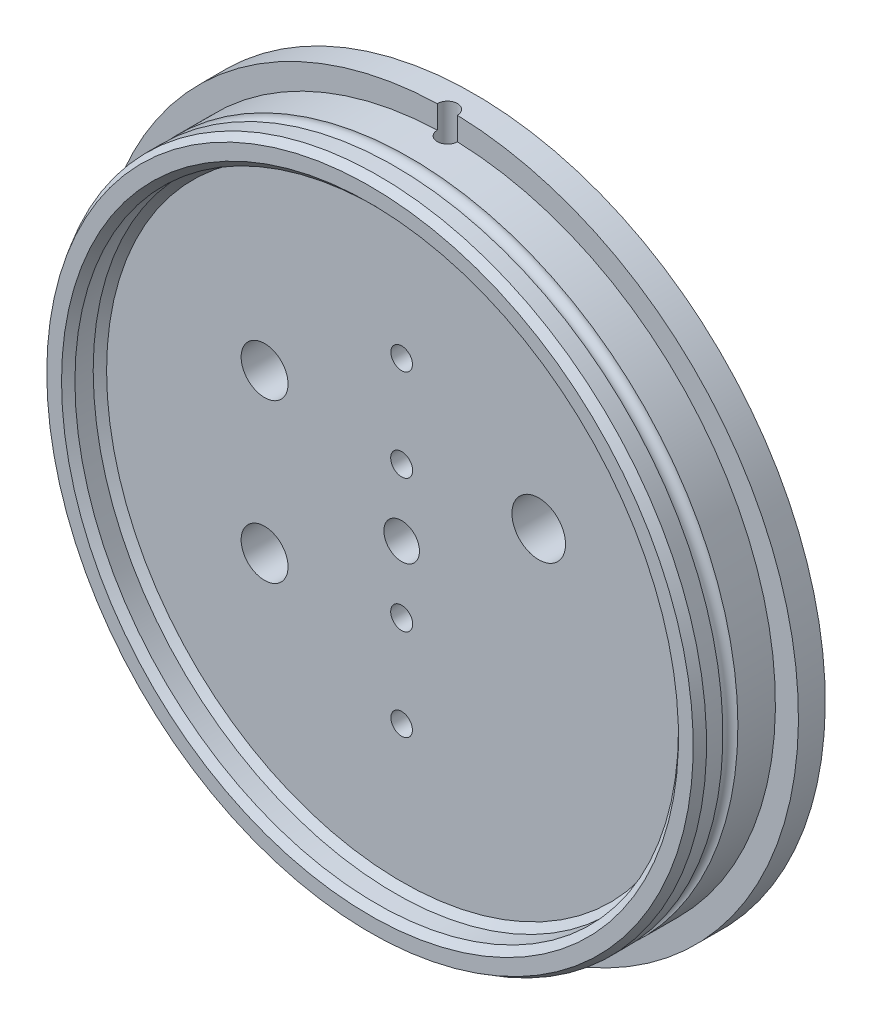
ISO-10303-21;
HEADER;
FILE_DESCRIPTION(('STEP AP214'),'2;1');
FILE_NAME('part.step','',(''),(''),'','','');
FILE_SCHEMA(('AUTOMOTIVE_DESIGN { 1 0 10303 214 1 1 1 1 }'));
ENDSEC;
DATA;
#1=APPLICATION_CONTEXT('core data for automotive mechanical design processes');
#2=APPLICATION_PROTOCOL_DEFINITION('international standard','automotive_design',2000,#1);
#3=PRODUCT_CONTEXT('',#1,'mechanical');
#4=PRODUCT('Part','Part','',(#3));
#5=PRODUCT_RELATED_PRODUCT_CATEGORY('part','',(#4));
#6=PRODUCT_DEFINITION_FORMATION('','',#4);
#7=PRODUCT_DEFINITION_CONTEXT('part definition',#1,'design');
#8=PRODUCT_DEFINITION('design','',#6,#7);
#9=PRODUCT_DEFINITION_SHAPE('','',#8);
#10=(LENGTH_UNIT() NAMED_UNIT(*) SI_UNIT(.MILLI.,.METRE.));
#11=(NAMED_UNIT(*) PLANE_ANGLE_UNIT() SI_UNIT($,.RADIAN.));
#12=(NAMED_UNIT(*) SI_UNIT($,.STERADIAN.) SOLID_ANGLE_UNIT());
#13=UNCERTAINTY_MEASURE_WITH_UNIT(LENGTH_MEASURE(1.E-05),#10,'distance_accuracy_value','');
#14=(GEOMETRIC_REPRESENTATION_CONTEXT(3) GLOBAL_UNCERTAINTY_ASSIGNED_CONTEXT((#13)) GLOBAL_UNIT_ASSIGNED_CONTEXT((#10,
#11,#12)) REPRESENTATION_CONTEXT('',''));
#15=CARTESIAN_POINT('',(0.,0.,0.));
#16=DIRECTION('',(0.,0.,1.));
#17=DIRECTION('',(1.,0.,0.));
#18=AXIS2_PLACEMENT_3D('',#15,#16,#17);
#19=CARTESIAN_POINT('',(0.,0.,24.9418));
#20=DIRECTION('',(0.,0.,1.));
#21=DIRECTION('',(1.,0.,0.));
#22=AXIS2_PLACEMENT_3D('',#19,#20,#21);
#23=CYLINDRICAL_SURFACE('',#22,1.905);
#24=CARTESIAN_POINT('',(0.,0.,24.9418));
#25=DIRECTION('',(0.,0.,-1.));
#26=DIRECTION('',(-1.,0.,0.));
#27=AXIS2_PLACEMENT_3D('',#24,#25,#26);
#28=CIRCLE('',#27,1.905);
#29=CARTESIAN_POINT('',(-1.905,0.,24.9418));
#30=VERTEX_POINT('',#29);
#31=EDGE_CURVE('E288',#30,#30,#28,.T.);
#32=ORIENTED_EDGE('',*,*,#31,.T.);
#33=EDGE_LOOP('',(#32));
#34=FACE_BOUND('',#33,.T.);
#35=CARTESIAN_POINT('',(0.,0.,32.257));
#36=DIRECTION('',(0.,0.,1.));
#37=DIRECTION('',(1.,0.,0.));
#38=AXIS2_PLACEMENT_3D('',#35,#36,#37);
#39=CIRCLE('',#38,1.905);
#40=CARTESIAN_POINT('',(1.905,0.,32.257));
#41=VERTEX_POINT('',#40);
#42=EDGE_CURVE('E261',#41,#41,#39,.T.);
#43=ORIENTED_EDGE('',*,*,#42,.T.);
#44=EDGE_LOOP('',(#43));
#45=FACE_BOUND('',#44,.T.);
#46=ADVANCED_FACE('F43',(#34,#45),#23,.F.);
#47=CARTESIAN_POINT('',(1.87350135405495E-13,0.,28.1168));
#48=DIRECTION('',(0.,0.,-1.));
#49=DIRECTION('',(-1.,0.,0.));
#50=AXIS2_PLACEMENT_3D('',#47,#48,#49);
#51=PLANE('',#50);
#52=CARTESIAN_POINT('',(0.,0.,28.1168));
#53=DIRECTION('',(0.,0.,-1.));
#54=DIRECTION('',(-1.,0.,0.));
#55=AXIS2_PLACEMENT_3D('',#52,#53,#54);
#56=CIRCLE('',#55,67.78625);
#57=CARTESIAN_POINT('',(-67.78625,0.,28.1168));
#58=VERTEX_POINT('',#57);
#59=EDGE_CURVE('E12',#58,#58,#56,.T.);
#60=ORIENTED_EDGE('',*,*,#59,.T.);
#61=EDGE_LOOP('',(#60));
#62=FACE_BOUND('',#61,.T.);
#63=CARTESIAN_POINT('',(0.,0.,28.1168));
#64=DIRECTION('',(0.,0.,-1.));
#65=DIRECTION('',(-1.,0.,0.));
#66=AXIS2_PLACEMENT_3D('',#63,#64,#65);
#67=CIRCLE('',#66,6.50875000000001);
#68=CARTESIAN_POINT('',(-6.50875000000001,0.,28.1168));
#69=VERTEX_POINT('',#68);
#70=EDGE_CURVE('E251',#69,#69,#67,.F.);
#71=ORIENTED_EDGE('',*,*,#70,.T.);
#72=EDGE_LOOP('',(#71));
#73=FACE_BOUND('',#72,.T.);
#74=CARTESIAN_POINT('',(32.4759526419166,18.7499999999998,28.1168));
#75=DIRECTION('',(0.,0.,-1.));
#76=DIRECTION('',(-1.,0.,0.));
#77=AXIS2_PLACEMENT_3D('',#74,#75,#76);
#78=CIRCLE('',#77,6.35);
#79=CARTESIAN_POINT('',(26.1259526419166,18.7499999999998,28.1168));
#80=VERTEX_POINT('',#79);
#81=EDGE_CURVE('E121',#80,#80,#78,.F.);
#82=ORIENTED_EDGE('',*,*,#81,.T.);
#83=EDGE_LOOP('',(#82));
#84=FACE_BOUND('',#83,.T.);
#85=CARTESIAN_POINT('',(-41.758190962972,-41.7581909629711,28.1168));
#86=DIRECTION('',(0.,0.,-1.));
#87=DIRECTION('',(-1.,0.,0.));
#88=AXIS2_PLACEMENT_3D('',#85,#86,#87);
#89=CIRCLE('',#88,1.64999999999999);
#90=CARTESIAN_POINT('',(-43.408190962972,-41.7581909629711,28.1168));
#91=VERTEX_POINT('',#90);
#92=EDGE_CURVE('E326',#91,#91,#89,.T.);
#93=ORIENTED_EDGE('',*,*,#92,.F.);
#94=EDGE_LOOP('',(#93));
#95=FACE_BOUND('',#94,.T.);
#96=CARTESIAN_POINT('',(-41.7581909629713,41.7581909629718,28.1168));
#97=DIRECTION('',(0.,0.,-1.));
#98=DIRECTION('',(-1.,0.,0.));
#99=AXIS2_PLACEMENT_3D('',#96,#97,#98);
#100=CIRCLE('',#99,1.65);
#101=CARTESIAN_POINT('',(-43.4081909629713,41.7581909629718,28.1168));
#102=VERTEX_POINT('',#101);
#103=EDGE_CURVE('E323',#102,#102,#100,.T.);
#104=ORIENTED_EDGE('',*,*,#103,.F.);
#105=EDGE_LOOP('',(#104));
#106=FACE_BOUND('',#105,.T.);
#107=CARTESIAN_POINT('',(41.758190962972,41.7581909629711,28.1168));
#108=DIRECTION('',(0.,0.,-1.));
#109=DIRECTION('',(-1.,0.,0.));
#110=AXIS2_PLACEMENT_3D('',#107,#108,#109);
#111=CIRCLE('',#110,1.65000000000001);
#112=CARTESIAN_POINT('',(40.108190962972,41.7581909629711,28.1168));
#113=VERTEX_POINT('',#112);
#114=EDGE_CURVE('E327',#113,#113,#111,.T.);
#115=ORIENTED_EDGE('',*,*,#114,.F.);
#116=EDGE_LOOP('',(#115));
#117=FACE_BOUND('',#116,.T.);
#118=CARTESIAN_POINT('',(41.7581909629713,-41.7581909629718,28.1168));
#119=DIRECTION('',(0.,0.,-1.));
#120=DIRECTION('',(-1.,0.,0.));
#121=AXIS2_PLACEMENT_3D('',#118,#119,#120);
#122=CIRCLE('',#121,1.65000000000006);
#123=CARTESIAN_POINT('',(40.1081909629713,-41.7581909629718,28.1168));
#124=VERTEX_POINT('',#123);
#125=EDGE_CURVE('E322',#124,#124,#122,.T.);
#126=ORIENTED_EDGE('',*,*,#125,.F.);
#127=EDGE_LOOP('',(#126));
#128=FACE_BOUND('',#127,.T.);
#129=CARTESIAN_POINT('',(-32.4759526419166,-18.7499999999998,28.1168));
#130=DIRECTION('',(0.,0.,-1.));
#131=DIRECTION('',(-1.,0.,0.));
#132=AXIS2_PLACEMENT_3D('',#129,#130,#131);
#133=CIRCLE('',#132,5.55625);
#134=CARTESIAN_POINT('',(-38.0322026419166,-18.7499999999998,28.1168));
#135=VERTEX_POINT('',#134);
#136=EDGE_CURVE('E307',#135,#135,#133,.F.);
#137=ORIENTED_EDGE('',*,*,#136,.T.);
#138=EDGE_LOOP('',(#137));
#139=FACE_BOUND('',#138,.T.);
#140=CARTESIAN_POINT('',(-32.4759526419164,18.75,28.1168));
#141=DIRECTION('',(0.,0.,-1.));
#142=DIRECTION('',(-1.,0.,0.));
#143=AXIS2_PLACEMENT_3D('',#140,#141,#142);
#144=CIRCLE('',#143,5.55625);
#145=CARTESIAN_POINT('',(-38.0322026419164,18.75,28.1168));
#146=VERTEX_POINT('',#145);
#147=EDGE_CURVE('E315',#146,#146,#144,.F.);
#148=ORIENTED_EDGE('',*,*,#147,.T.);
#149=EDGE_LOOP('',(#148));
#150=FACE_BOUND('',#149,.T.);
#151=ADVANCED_FACE('F213',(#62,#73,#84,#95,#106,#117,#128,#139,#150),#51,.T.);
#152=CARTESIAN_POINT('',(1.87350135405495E-13,0.,130.327878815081));
#153=DIRECTION('',(0.,0.,1.));
#154=DIRECTION('',(1.,0.,0.));
#155=AXIS2_PLACEMENT_3D('',#152,#153,#154);
#156=CYLINDRICAL_SURFACE('',#155,77.7286000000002);
#157=CARTESIAN_POINT('',(-2.38124999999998,77.6921161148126,30.));
#158=CARTESIAN_POINT('',(-2.38124957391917,77.6921156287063,30.0669774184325));
#159=CARTESIAN_POINT('',(-2.37842241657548,77.6922028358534,30.1339227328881));
#160=CARTESIAN_POINT('',(-2.36714385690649,77.6925474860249,30.2673340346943));
#161=CARTESIAN_POINT('',(-2.35869273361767,77.6928049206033,30.3338000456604));
#162=CARTESIAN_POINT('',(-2.32498316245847,77.6938237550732,30.531653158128));
#163=CARTESIAN_POINT('',(-2.29136829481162,77.6948317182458,30.661714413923));
#164=CARTESIAN_POINT('',(-2.2027906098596,77.6973932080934,30.9143382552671));
#165=CARTESIAN_POINT('',(-2.14781806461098,77.6989469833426,31.0368973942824));
#166=CARTESIAN_POINT('',(-2.01809373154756,77.7024243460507,31.271042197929));
#167=CARTESIAN_POINT('',(-1.94334568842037,77.7043478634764,31.3826299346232));
#168=CARTESIAN_POINT('',(-1.77616091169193,77.7083488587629,31.5917064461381));
#169=CARTESIAN_POINT('',(-1.68371862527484,77.7104263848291,31.6891907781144));
#170=CARTESIAN_POINT('',(-1.48376581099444,77.7145010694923,31.8672749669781));
#171=CARTESIAN_POINT('',(-1.37625299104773,77.7164982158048,31.9478722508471));
#172=CARTESIAN_POINT('',(-1.14920095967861,77.7201870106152,32.0898856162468));
#173=CARTESIAN_POINT('',(-1.02965991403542,77.7218786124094,32.1512987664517));
#174=CARTESIAN_POINT('',(-0.781965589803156,77.7247651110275,32.2531784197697));
#175=CARTESIAN_POINT('',(-0.653812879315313,77.7259600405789,32.2936463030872));
#176=CARTESIAN_POINT('',(-0.392566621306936,77.7277183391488,32.3524807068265));
#177=CARTESIAN_POINT('',(-0.259474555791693,77.7282818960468,32.3708538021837));
#178=CARTESIAN_POINT('',(0.00790923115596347,77.7287145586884,32.3849974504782));
#179=CARTESIAN_POINT('',(0.142200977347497,77.7285836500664,32.3807675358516));
#180=CARTESIAN_POINT('',(0.408120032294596,77.7276422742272,32.3498299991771));
#181=CARTESIAN_POINT('',(0.539748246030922,77.7268320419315,32.3231301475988));
#182=CARTESIAN_POINT('',(0.796652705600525,77.7246236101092,32.248022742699));
#183=CARTESIAN_POINT('',(0.921928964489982,77.7232254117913,32.1996152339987));
#184=CARTESIAN_POINT('',(1.1626014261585,77.7199981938,32.0824566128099));
#185=CARTESIAN_POINT('',(1.27799568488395,77.7181690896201,32.0137015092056));
#186=CARTESIAN_POINT('',(1.49560093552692,77.7142863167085,31.85780569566));
#187=CARTESIAN_POINT('',(1.59781253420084,77.7122326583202,31.7706658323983));
#188=CARTESIAN_POINT('',(1.78618896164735,77.7081314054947,31.5804444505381));
#189=CARTESIAN_POINT('',(1.87234933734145,77.7060838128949,31.4773585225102));
#190=CARTESIAN_POINT('',(2.0261691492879,77.7022254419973,31.2581414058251));
#191=CARTESIAN_POINT('',(2.09382272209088,77.7004147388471,31.1420060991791));
#192=CARTESIAN_POINT('',(2.20870461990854,77.6972341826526,30.8999695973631));
#193=CARTESIAN_POINT('',(2.2559203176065,77.6958646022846,30.7740624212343));
#194=CARTESIAN_POINT('',(2.32846918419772,77.6937245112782,30.5162008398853));
#195=CARTESIAN_POINT('',(2.35383574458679,77.6929530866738,30.3842559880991));
#196=CARTESIAN_POINT('',(2.37238822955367,77.6923872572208,30.2095250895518));
#197=CARTESIAN_POINT('',(2.37571314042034,77.692285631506,30.1676522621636));
#198=CARTESIAN_POINT('',(2.38014099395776,77.6921501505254,30.0838586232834));
#199=CARTESIAN_POINT('',(2.38124760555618,77.6921161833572,30.0419380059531));
#200=CARTESIAN_POINT('',(2.38125000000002,77.6921161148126,30.));
#201=B_SPLINE_CURVE_WITH_KNOTS('',3,(#157,#158,#159,#160,#161,#162,#163,#164,#165,#166,#167,
#168,#169,#170,#171,#172,#173,#174,#175,#176,#177,#178,#179,#180,#181,#182,#183,#184,#185,#186,
#187,#188,#189,#190,#191,#192,#193,#194,#195,#196,#197,#198,#199,#200),.UNSPECIFIED.,.F.,.F.,(4,
2,2,2,2,2,2,2,2,2,2,2,2,2,2,2,2,2,2,2,2,4),(0.,0.20080878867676,0.401607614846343,
0.80255641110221,1.20368804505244,1.60474377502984,2.00592557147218,2.40716845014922,
2.80847260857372,3.20975031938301,3.61090858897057,4.01207515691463,4.41310305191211,
4.81413012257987,5.21523590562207,5.61632322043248,6.01752164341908,6.41884702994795,
6.82042001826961,7.22137819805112,7.34735135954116,7.47311599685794),.UNSPECIFIED.);
#202=CARTESIAN_POINT('',(-2.38124999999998,77.6921161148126,30.));
#203=VERTEX_POINT('',#202);
#204=CARTESIAN_POINT('',(2.38125000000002,77.6921161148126,30.));
#205=VERTEX_POINT('',#204);
#206=EDGE_CURVE('E62',#203,#205,#201,.T.);
#207=ORIENTED_EDGE('',*,*,#206,.F.);
#208=CARTESIAN_POINT('',(1.87350135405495E-13,0.,30.));
#209=DIRECTION('',(0.,0.,1.));
#210=DIRECTION('',(1.,0.,0.));
#211=AXIS2_PLACEMENT_3D('',#208,#209,#210);
#212=CIRCLE('',#211,77.7286000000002);
#213=EDGE_CURVE('E83',#203,#205,#212,.T.);
#214=ORIENTED_EDGE('',*,*,#213,.T.);
#215=EDGE_LOOP('',(#207,#214));
#216=FACE_BOUND('',#215,.T.);
#217=CARTESIAN_POINT('',(0.,0.,38.89));
#218=DIRECTION('',(0.,0.,-1.));
#219=DIRECTION('',(-1.,0.,0.));
#220=AXIS2_PLACEMENT_3D('',#217,#218,#219);
#221=CIRCLE('',#220,77.7286000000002);
#222=CARTESIAN_POINT('',(-77.7286000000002,0.,38.89));
#223=VERTEX_POINT('',#222);
#224=EDGE_CURVE('E305',#223,#223,#221,.T.);
#225=ORIENTED_EDGE('',*,*,#224,.T.);
#226=EDGE_LOOP('',(#225));
#227=FACE_BOUND('',#226,.T.);
#228=ADVANCED_FACE('F155',(#216,#227),#156,.T.);
#229=CARTESIAN_POINT('',(-83.1850015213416,0.,30.));
#230=DIRECTION('',(0.,0.,-1.));
#231=DIRECTION('',(-1.,0.,0.));
#232=AXIS2_PLACEMENT_3D('',#229,#230,#231);
#233=PLANE('',#232);
#234=ORIENTED_EDGE('',*,*,#213,.F.);
#235=DIRECTION('',(0.,1.,0.));
#236=VECTOR('',#235,1.);
#237=CARTESIAN_POINT('',(-2.38124999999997,72.9026000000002,30.));
#238=LINE('',#237,#236);
#239=CARTESIAN_POINT('',(-2.38124999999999,83.1509117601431,30.));
#240=VERTEX_POINT('',#239);
#241=EDGE_CURVE('E58',#203,#240,#238,.T.);
#242=ORIENTED_EDGE('',*,*,#241,.T.);
#243=CARTESIAN_POINT('',(0.,0.,30.));
#244=DIRECTION('',(0.,0.,1.));
#245=DIRECTION('',(1.,0.,0.));
#246=AXIS2_PLACEMENT_3D('',#243,#244,#245);
#247=CIRCLE('',#246,83.1850015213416);
#248=CARTESIAN_POINT('',(2.38125000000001,83.1509117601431,30.));
#249=VERTEX_POINT('',#248);
#250=EDGE_CURVE('E81',#249,#240,#247,.F.);
#251=ORIENTED_EDGE('',*,*,#250,.F.);
#252=DIRECTION('',(0.,1.,0.));
#253=VECTOR('',#252,1.);
#254=CARTESIAN_POINT('',(2.38125000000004,72.9026000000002,30.));
#255=LINE('',#254,#253);
#256=EDGE_CURVE('E71',#249,#205,#255,.F.);
#257=ORIENTED_EDGE('',*,*,#256,.T.);
#258=EDGE_LOOP('',(#234,#242,#251,#257));
#259=FACE_BOUND('',#258,.T.);
#260=ADVANCED_FACE('F80',(#259),#233,.F.);
#261=CARTESIAN_POINT('',(0.,0.,42.446));
#262=DIRECTION('',(0.,0.,-1.));
#263=DIRECTION('',(-1.,0.,0.));
#264=AXIS2_PLACEMENT_3D('',#261,#262,#263);
#265=CIRCLE('',#264,77.7286000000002);
#266=CARTESIAN_POINT('',(-77.7286000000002,0.,42.446));
#267=VERTEX_POINT('',#266);
#268=EDGE_CURVE('E147',#267,#267,#265,.T.);
#269=ORIENTED_EDGE('',*,*,#268,.F.);
#270=EDGE_LOOP('',(#269));
#271=FACE_BOUND('',#270,.T.);
#272=CARTESIAN_POINT('',(1.87350135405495E-13,0.,46.3168000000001));
#273=DIRECTION('',(0.,0.,-1.));
#274=DIRECTION('',(-1.,0.,0.));
#275=AXIS2_PLACEMENT_3D('',#272,#273,#274);
#276=CIRCLE('',#275,77.7286000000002);
#277=CARTESIAN_POINT('',(-77.7286,0.,46.3168000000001));
#278=VERTEX_POINT('',#277);
#279=EDGE_CURVE('E87',#278,#278,#276,.F.);
#280=ORIENTED_EDGE('',*,*,#279,.F.);
#281=EDGE_LOOP('',(#280));
#282=FACE_BOUND('',#281,.T.);
#283=ADVANCED_FACE('F150',(#271,#282),#156,.T.);
#284=CARTESIAN_POINT('',(0.,0.,407.444180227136));
#285=DIRECTION('',(0.,0.,1.));
#286=DIRECTION('',(1.,0.,0.));
#287=AXIS2_PLACEMENT_3D('',#284,#285,#286);
#288=CYLINDRICAL_SURFACE('',#287,83.1850015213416);
#289=CARTESIAN_POINT('',(2.38125000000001,83.1509117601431,30.));
#290=CARTESIAN_POINT('',(2.38124957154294,83.1509113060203,29.9330204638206));
#291=CARTESIAN_POINT('',(2.37842223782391,83.1509927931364,29.8660730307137));
#292=CARTESIAN_POINT('',(2.3671429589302,83.1513148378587,29.7326574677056));
#293=CARTESIAN_POINT('',(2.35869129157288,83.1515553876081,29.6661893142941));
#294=CARTESIAN_POINT('',(2.32497945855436,83.1525074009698,29.4683294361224));
#295=CARTESIAN_POINT('',(2.29136224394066,83.1534492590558,29.3382635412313));
#296=CARTESIAN_POINT('',(2.20277796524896,83.1558427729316,29.0856304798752));
#297=CARTESIAN_POINT('',(2.14780115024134,83.1572946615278,28.9630667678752));
#298=CARTESIAN_POINT('',(2.0180663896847,83.1605440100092,28.728913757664));
#299=CARTESIAN_POINT('',(1.94331220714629,83.1623414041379,28.6173223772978));
#300=CARTESIAN_POINT('',(1.77611671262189,83.1660799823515,28.4082441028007));
#301=CARTESIAN_POINT('',(1.68367050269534,83.1680212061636,28.3107611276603));
#302=CARTESIAN_POINT('',(1.48371006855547,83.1718285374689,28.1326806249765));
#303=CARTESIAN_POINT('',(1.37619355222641,83.1736946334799,28.0520856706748));
#304=CARTESIAN_POINT('',(1.1491378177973,83.1771412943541,27.910079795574));
#305=CARTESIAN_POINT('',(1.02959706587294,83.1787218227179,27.8486713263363));
#306=CARTESIAN_POINT('',(0.781904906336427,83.1814187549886,27.7468006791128));
#307=CARTESIAN_POINT('',(0.653754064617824,83.1825351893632,27.7063371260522));
#308=CARTESIAN_POINT('',(0.39250757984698,83.1841779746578,27.6475093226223));
#309=CARTESIAN_POINT('',(0.259413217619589,83.1847044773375,27.6291393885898));
#310=CARTESIAN_POINT('',(-0.00797446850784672,83.1851085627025,27.6150026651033));
#311=CARTESIAN_POINT('',(-0.142267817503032,83.1849861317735,27.619236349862));
#312=CARTESIAN_POINT('',(-0.408195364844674,83.184106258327,27.6501826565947));
#313=CARTESIAN_POINT('',(-0.539830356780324,83.1833490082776,27.6768884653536));
#314=CARTESIAN_POINT('',(-0.796747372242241,83.1812850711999,27.752010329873));
#315=CARTESIAN_POINT('',(-0.922029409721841,83.1799783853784,27.8004263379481));
#316=CARTESIAN_POINT('',(-1.16270916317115,83.1769624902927,27.917603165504));
#317=CARTESIAN_POINT('',(-1.2781051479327,83.1752532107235,27.9863675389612));
#318=CARTESIAN_POINT('',(-1.49571185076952,83.171624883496,28.142283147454));
#319=CARTESIAN_POINT('',(-1.59792318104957,83.169705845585,28.2294335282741));
#320=CARTESIAN_POINT('',(-1.78629150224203,83.1658736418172,28.4196714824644));
#321=CARTESIAN_POINT('',(-1.87244487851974,83.1639604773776,28.5227626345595));
#322=CARTESIAN_POINT('',(-2.02624978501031,83.1603555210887,28.74198853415));
#323=CARTESIAN_POINT('',(-2.09389544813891,83.158663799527,28.8581274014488));
#324=CARTESIAN_POINT('',(-2.2087609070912,83.1556923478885,29.1001687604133));
#325=CARTESIAN_POINT('',(-2.25596810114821,83.1544128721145,29.2260772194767));
#326=CARTESIAN_POINT('',(-2.32850010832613,83.1524136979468,29.483939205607));
#327=CARTESIAN_POINT('',(-2.35385831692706,83.1516931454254,29.6158831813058));
#328=CARTESIAN_POINT('',(-2.3723979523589,83.1511648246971,29.7905896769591));
#329=CARTESIAN_POINT('',(-2.37571921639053,83.1510699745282,29.8324396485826));
#330=CARTESIAN_POINT('',(-2.38014221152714,83.1509435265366,29.9161874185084));
#331=CARTESIAN_POINT('',(-2.38124760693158,83.1509118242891,29.9580850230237));
#332=CARTESIAN_POINT('',(-2.38124999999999,83.1509117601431,30.));
#333=B_SPLINE_CURVE_WITH_KNOTS('',3,(#289,#290,#291,#292,#293,#294,#295,#296,#297,#298,#299,
#300,#301,#302,#303,#304,#305,#306,#307,#308,#309,#310,#311,#312,#313,#314,#315,#316,#317,#318,
#319,#320,#321,#322,#323,#324,#325,#326,#327,#328,#329,#330,#331,#332),.UNSPECIFIED.,.F.,.F.,(4,
2,2,2,2,2,2,2,2,2,2,2,2,2,2,2,2,2,2,2,2,4),(0.,0.20081514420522,0.401620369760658,
0.802582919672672,1.20372872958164,1.60479826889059,2.00597900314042,2.40722082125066,
2.80851388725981,3.20978060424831,3.6109440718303,4.0121159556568,4.41316625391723,
4.81421567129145,5.21533517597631,5.61643604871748,6.01762710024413,6.41894518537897,
6.82051036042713,7.22146066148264,7.34736464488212,7.47306025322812),.UNSPECIFIED.);
#334=EDGE_CURVE('E68',#249,#240,#333,.T.);
#335=ORIENTED_EDGE('',*,*,#334,.F.);
#336=ORIENTED_EDGE('',*,*,#250,.T.);
#337=EDGE_LOOP('',(#335,#336));
#338=FACE_BOUND('',#337,.T.);
#339=CARTESIAN_POINT('',(0.,0.,23.65));
#340=DIRECTION('',(0.,0.,1.));
#341=DIRECTION('',(0.,-1.,0.));
#342=AXIS2_PLACEMENT_3D('',#339,#340,#341);
#343=CIRCLE('',#342,83.1850015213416);
#344=CARTESIAN_POINT('',(0.,-83.1850015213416,23.65));
#345=VERTEX_POINT('',#344);
#346=EDGE_CURVE('E92',#345,#345,#343,.F.);
#347=ORIENTED_EDGE('',*,*,#346,.F.);
#348=EDGE_LOOP('',(#347));
#349=FACE_BOUND('',#348,.T.);
#350=ADVANCED_FACE('F85',(#338,#349),#288,.T.);
#351=CARTESIAN_POINT('',(1.87350135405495E-13,0.,46.3168000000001));
#352=DIRECTION('',(0.,0.,-1.));
#353=DIRECTION('',(-1.,0.,0.));
#354=AXIS2_PLACEMENT_3D('',#351,#352,#353);
#355=CONICAL_SURFACE('',#354,77.7286000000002,0.523598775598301);
#356=CARTESIAN_POINT('',(1.87350135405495E-13,0.,48.3168));
#357=DIRECTION('',(0.,0.,-1.));
#358=DIRECTION('',(-1.,0.,0.));
#359=AXIS2_PLACEMENT_3D('',#356,#357,#358);
#360=CIRCLE('',#359,76.573899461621);
#361=CARTESIAN_POINT('',(-76.5738994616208,0.,48.3168));
#362=VERTEX_POINT('',#361);
#363=EDGE_CURVE('E90',#362,#362,#360,.T.);
#364=ORIENTED_EDGE('',*,*,#363,.T.);
#365=EDGE_LOOP('',(#364));
#366=FACE_BOUND('',#365,.T.);
#367=ORIENTED_EDGE('',*,*,#279,.T.);
#368=EDGE_LOOP('',(#367));
#369=FACE_BOUND('',#368,.T.);
#370=ADVANCED_FACE('F338',(#366,#369),#355,.T.);
#371=CARTESIAN_POINT('',(-77.7286,0.,48.3168));
#372=DIRECTION('',(0.,0.,-1.));
#373=DIRECTION('',(-1.,0.,0.));
#374=AXIS2_PLACEMENT_3D('',#371,#372,#373);
#375=PLANE('',#374);
#376=CARTESIAN_POINT('',(0.,0.,48.3168));
#377=DIRECTION('',(0.,0.,-1.));
#378=DIRECTION('',(-1.,0.,0.));
#379=AXIS2_PLACEMENT_3D('',#376,#377,#378);
#380=CIRCLE('',#379,73.0813994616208);
#381=CARTESIAN_POINT('',(-73.0813994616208,0.,48.3168));
#382=VERTEX_POINT('',#381);
#383=EDGE_CURVE('E274',#382,#382,#380,.T.);
#384=ORIENTED_EDGE('',*,*,#383,.T.);
#385=EDGE_LOOP('',(#384));
#386=FACE_BOUND('',#385,.T.);
#387=ORIENTED_EDGE('',*,*,#363,.F.);
#388=EDGE_LOOP('',(#387));
#389=FACE_BOUND('',#388,.T.);
#390=ADVANCED_FACE('F302',(#386,#389),#375,.F.);
#391=CARTESIAN_POINT('',(-83.1850015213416,85.4620754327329,23.65));
#392=DIRECTION('',(0.,0.,1.));
#393=DIRECTION('',(0.,-1.,0.));
#394=AXIS2_PLACEMENT_3D('',#391,#392,#393);
#395=PLANE('',#394);
#396=CARTESIAN_POINT('',(0.,0.,23.65));
#397=DIRECTION('',(0.,0.,1.));
#398=DIRECTION('',(0.,-1.,0.));
#399=AXIS2_PLACEMENT_3D('',#396,#397,#398);
#400=CIRCLE('',#399,70.1675);
#401=CARTESIAN_POINT('',(0.,-70.1675,23.65));
#402=VERTEX_POINT('',#401);
#403=EDGE_CURVE('E248',#402,#402,#400,.T.);
#404=ORIENTED_EDGE('',*,*,#403,.T.);
#405=EDGE_LOOP('',(#404));
#406=FACE_BOUND('',#405,.T.);
#407=ORIENTED_EDGE('',*,*,#346,.T.);
#408=EDGE_LOOP('',(#407));
#409=FACE_BOUND('',#408,.T.);
#410=ADVANCED_FACE('F158',(#406,#409),#395,.F.);
#411=CARTESIAN_POINT('',(-41.758190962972,-41.7581909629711,35.7368));
#412=DIRECTION('',(0.,0.,-1.));
#413=DIRECTION('',(-1.,0.,0.));
#414=AXIS2_PLACEMENT_3D('',#411,#412,#413);
#415=CYLINDRICAL_SURFACE('',#414,1.64999999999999);
#416=CARTESIAN_POINT('',(-41.758190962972,-41.7581909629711,34.94305));
#417=DIRECTION('',(0.,0.,-1.));
#418=DIRECTION('',(-1.,0.,0.));
#419=AXIS2_PLACEMENT_3D('',#416,#417,#418);
#420=CIRCLE('',#419,1.64999999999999);
#421=CARTESIAN_POINT('',(-43.408190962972,-41.7581909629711,34.94305));
#422=VERTEX_POINT('',#421);
#423=EDGE_CURVE('E105',#422,#422,#420,.F.);
#424=CARTESIAN_POINT('',(-43.408190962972,-41.7581909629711,34.94305));
#425=CARTESIAN_POINT('',(-43.408190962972,-41.7581909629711,34.8719432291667));
#426=CARTESIAN_POINT('',(-43.408190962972,-41.7581909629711,34.8008364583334));
#427=CARTESIAN_POINT('',(-43.408190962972,-41.7581909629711,34.6586229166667));
#428=CARTESIAN_POINT('',(-43.408190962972,-41.7581909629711,34.5875161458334));
#429=CARTESIAN_POINT('',(-43.408190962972,-41.7581909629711,34.4453026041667));
#430=CARTESIAN_POINT('',(-43.408190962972,-41.7581909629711,34.3741958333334));
#431=CARTESIAN_POINT('',(-43.408190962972,-41.7581909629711,34.2319822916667));
#432=CARTESIAN_POINT('',(-43.408190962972,-41.7581909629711,34.1608755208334));
#433=CARTESIAN_POINT('',(-43.408190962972,-41.7581909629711,34.0186619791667));
#434=CARTESIAN_POINT('',(-43.408190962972,-41.7581909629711,33.9475552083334));
#435=CARTESIAN_POINT('',(-43.408190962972,-41.7581909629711,33.8053416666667));
#436=CARTESIAN_POINT('',(-43.408190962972,-41.7581909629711,33.7342348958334));
#437=CARTESIAN_POINT('',(-43.408190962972,-41.7581909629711,33.5920213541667));
#438=CARTESIAN_POINT('',(-43.408190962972,-41.7581909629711,33.5209145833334));
#439=CARTESIAN_POINT('',(-43.408190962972,-41.7581909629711,33.3787010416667));
#440=CARTESIAN_POINT('',(-43.408190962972,-41.7581909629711,33.3075942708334));
#441=CARTESIAN_POINT('',(-43.408190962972,-41.7581909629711,33.1653807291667));
#442=CARTESIAN_POINT('',(-43.408190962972,-41.7581909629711,33.0942739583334));
#443=CARTESIAN_POINT('',(-43.408190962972,-41.7581909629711,32.9520604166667));
#444=CARTESIAN_POINT('',(-43.408190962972,-41.7581909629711,32.8809536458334));
#445=CARTESIAN_POINT('',(-43.408190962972,-41.7581909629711,32.7387401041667));
#446=CARTESIAN_POINT('',(-43.408190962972,-41.7581909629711,32.6676333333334));
#447=CARTESIAN_POINT('',(-43.408190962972,-41.7581909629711,32.5254197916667));
#448=CARTESIAN_POINT('',(-43.408190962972,-41.7581909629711,32.4543130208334));
#449=CARTESIAN_POINT('',(-43.408190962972,-41.7581909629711,32.3120994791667));
#450=CARTESIAN_POINT('',(-43.408190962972,-41.7581909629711,32.2409927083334));
#451=CARTESIAN_POINT('',(-43.408190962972,-41.7581909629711,32.0987791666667));
#452=CARTESIAN_POINT('',(-43.408190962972,-41.7581909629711,32.0276723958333));
#453=CARTESIAN_POINT('',(-43.408190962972,-41.7581909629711,31.8854588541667));
#454=CARTESIAN_POINT('',(-43.408190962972,-41.7581909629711,31.8143520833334));
#455=CARTESIAN_POINT('',(-43.408190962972,-41.7581909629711,31.6721385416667));
#456=CARTESIAN_POINT('',(-43.408190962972,-41.7581909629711,31.6010317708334));
#457=CARTESIAN_POINT('',(-43.408190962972,-41.7581909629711,31.4588182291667));
#458=CARTESIAN_POINT('',(-43.408190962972,-41.7581909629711,31.3877114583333));
#459=CARTESIAN_POINT('',(-43.408190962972,-41.7581909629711,31.2454979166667));
#460=CARTESIAN_POINT('',(-43.408190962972,-41.7581909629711,31.1743911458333));
#461=CARTESIAN_POINT('',(-43.408190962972,-41.7581909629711,31.0321776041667));
#462=CARTESIAN_POINT('',(-43.408190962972,-41.7581909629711,30.9610708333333));
#463=CARTESIAN_POINT('',(-43.408190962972,-41.7581909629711,30.8188572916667));
#464=CARTESIAN_POINT('',(-43.408190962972,-41.7581909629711,30.7477505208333));
#465=CARTESIAN_POINT('',(-43.408190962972,-41.7581909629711,30.6055369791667));
#466=CARTESIAN_POINT('',(-43.408190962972,-41.7581909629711,30.5344302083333));
#467=CARTESIAN_POINT('',(-43.408190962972,-41.7581909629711,30.3922166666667));
#468=CARTESIAN_POINT('',(-43.408190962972,-41.7581909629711,30.3211098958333));
#469=CARTESIAN_POINT('',(-43.408190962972,-41.7581909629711,30.1788963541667));
#470=CARTESIAN_POINT('',(-43.408190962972,-41.7581909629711,30.1077895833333));
#471=CARTESIAN_POINT('',(-43.408190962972,-41.7581909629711,29.9655760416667));
#472=CARTESIAN_POINT('',(-43.408190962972,-41.7581909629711,29.8944692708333));
#473=CARTESIAN_POINT('',(-43.408190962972,-41.7581909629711,29.7522557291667));
#474=CARTESIAN_POINT('',(-43.408190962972,-41.7581909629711,29.6811489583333));
#475=CARTESIAN_POINT('',(-43.408190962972,-41.7581909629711,29.5389354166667));
#476=CARTESIAN_POINT('',(-43.408190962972,-41.7581909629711,29.4678286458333));
#477=CARTESIAN_POINT('',(-43.408190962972,-41.7581909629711,29.3256151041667));
#478=CARTESIAN_POINT('',(-43.408190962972,-41.7581909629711,29.2545083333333));
#479=CARTESIAN_POINT('',(-43.408190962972,-41.7581909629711,29.1122947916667));
#480=CARTESIAN_POINT('',(-43.408190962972,-41.7581909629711,29.0411880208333));
#481=CARTESIAN_POINT('',(-43.408190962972,-41.7581909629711,28.8989744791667));
#482=CARTESIAN_POINT('',(-43.408190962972,-41.7581909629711,28.8278677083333));
#483=CARTESIAN_POINT('',(-43.408190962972,-41.7581909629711,28.6856541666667));
#484=CARTESIAN_POINT('',(-43.408190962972,-41.7581909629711,28.6145473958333));
#485=CARTESIAN_POINT('',(-43.408190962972,-41.7581909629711,28.4723338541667));
#486=CARTESIAN_POINT('',(-43.408190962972,-41.7581909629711,28.4012270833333));
#487=CARTESIAN_POINT('',(-43.408190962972,-41.7581909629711,28.2590135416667));
#488=CARTESIAN_POINT('',(-43.408190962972,-41.7581909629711,28.1879067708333));
#489=CARTESIAN_POINT('',(-43.408190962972,-41.7581909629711,28.1168));
#490=B_SPLINE_CURVE_WITH_KNOTS('',3,(#424,#425,#426,#427,#428,#429,#430,#431,#432,#433,#434,
#435,#436,#437,#438,#439,#440,#441,#442,#443,#444,#445,#446,#447,#448,#449,#450,#451,#452,#453,
#454,#455,#456,#457,#458,#459,#460,#461,#462,#463,#464,#465,#466,#467,#468,#469,#470,#471,#472,
#473,#474,#475,#476,#477,#478,#479,#480,#481,#482,#483,#484,#485,#486,#487,#488,#489),
.UNSPECIFIED.,.F.,.F.,(4,2,2,2,2,2,2,2,2,2,2,2,2,2,2,2,2,2,2,2,2,2,2,2,2,2,2,2,2,2,2,2,4),(0.,
0.213320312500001,0.426640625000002,0.63996093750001,0.853281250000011,1.06660156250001,
1.27992187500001,1.49324218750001,1.70656250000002,1.91988281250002,2.13320312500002,
2.34652343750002,2.55984375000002,2.77316406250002,2.98648437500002,3.19980468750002,
3.41312500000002,3.62644531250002,3.83976562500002,4.05308593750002,4.26640625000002,
4.47972656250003,4.69304687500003,4.90636718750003,5.11968750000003,5.33300781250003,
5.54632812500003,5.75964843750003,5.97296875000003,6.18628906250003,6.39960937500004,
6.61292968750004,6.82625000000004),.UNSPECIFIED.);
#491=EDGE_CURVE('BSEAM352',#422,#91,#490,.T.);
#492=ORIENTED_EDGE('',*,*,#423,.T.);
#493=ORIENTED_EDGE('',*,*,#92,.T.);
#494=ORIENTED_EDGE('',*,*,#491,.T.);
#495=ORIENTED_EDGE('',*,*,#491,.F.);
#496=EDGE_LOOP('',(#492,#494,#493,#495));
#497=FACE_BOUND('',#496,.T.);
#498=ADVANCED_FACE('F352',(#497),#415,.F.);
#499=CARTESIAN_POINT('',(0.,0.,35.7368));
#500=DIRECTION('',(0.,0.,-1.));
#501=DIRECTION('',(-1.,0.,0.));
#502=AXIS2_PLACEMENT_3D('',#499,#500,#501);
#503=PLANE('',#502);
#504=CARTESIAN_POINT('',(-41.758190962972,-41.7581909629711,35.7368));
#505=DIRECTION('',(0.,0.,-1.));
#506=DIRECTION('',(-1.,0.,0.));
#507=AXIS2_PLACEMENT_3D('',#504,#505,#506);
#508=CIRCLE('',#507,0.856250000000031);
#509=CARTESIAN_POINT('',(-42.6144409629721,-41.7581909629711,35.7368));
#510=VERTEX_POINT('',#509);
#511=EDGE_CURVE('E102',#510,#510,#508,.T.);
#512=ORIENTED_EDGE('',*,*,#511,.T.);
#513=EDGE_LOOP('',(#512));
#514=FACE_BOUND('',#513,.T.);
#515=ADVANCED_FACE('F356',(#514),#503,.T.);
#516=CARTESIAN_POINT('',(-41.7581909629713,41.7581909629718,35.7368));
#517=DIRECTION('',(0.,0.,-1.));
#518=DIRECTION('',(-1.,0.,0.));
#519=AXIS2_PLACEMENT_3D('',#516,#517,#518);
#520=CYLINDRICAL_SURFACE('',#519,1.65);
#521=CARTESIAN_POINT('',(-41.7581909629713,41.7581909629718,34.9430500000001));
#522=DIRECTION('',(0.,0.,-1.));
#523=DIRECTION('',(-1.,0.,0.));
#524=AXIS2_PLACEMENT_3D('',#521,#522,#523);
#525=CIRCLE('',#524,1.65);
#526=CARTESIAN_POINT('',(-43.4081909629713,41.7581909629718,34.9430500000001));
#527=VERTEX_POINT('',#526);
#528=EDGE_CURVE('E76',#527,#527,#525,.F.);
#529=CARTESIAN_POINT('',(-43.4081909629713,41.7581909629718,34.9430500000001));
#530=CARTESIAN_POINT('',(-43.4081909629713,41.7581909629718,34.8719432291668));
#531=CARTESIAN_POINT('',(-43.4081909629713,41.7581909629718,34.8008364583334));
#532=CARTESIAN_POINT('',(-43.4081909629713,41.7581909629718,34.6586229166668));
#533=CARTESIAN_POINT('',(-43.4081909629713,41.7581909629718,34.5875161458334));
#534=CARTESIAN_POINT('',(-43.4081909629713,41.7581909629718,34.4453026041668));
#535=CARTESIAN_POINT('',(-43.4081909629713,41.7581909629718,34.3741958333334));
#536=CARTESIAN_POINT('',(-43.4081909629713,41.7581909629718,34.2319822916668));
#537=CARTESIAN_POINT('',(-43.4081909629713,41.7581909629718,34.1608755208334));
#538=CARTESIAN_POINT('',(-43.4081909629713,41.7581909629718,34.0186619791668));
#539=CARTESIAN_POINT('',(-43.4081909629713,41.7581909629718,33.9475552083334));
#540=CARTESIAN_POINT('',(-43.4081909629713,41.7581909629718,33.8053416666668));
#541=CARTESIAN_POINT('',(-43.4081909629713,41.7581909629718,33.7342348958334));
#542=CARTESIAN_POINT('',(-43.4081909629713,41.7581909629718,33.5920213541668));
#543=CARTESIAN_POINT('',(-43.4081909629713,41.7581909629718,33.5209145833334));
#544=CARTESIAN_POINT('',(-43.4081909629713,41.7581909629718,33.3787010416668));
#545=CARTESIAN_POINT('',(-43.4081909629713,41.7581909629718,33.3075942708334));
#546=CARTESIAN_POINT('',(-43.4081909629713,41.7581909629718,33.1653807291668));
#547=CARTESIAN_POINT('',(-43.4081909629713,41.7581909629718,33.0942739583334));
#548=CARTESIAN_POINT('',(-43.4081909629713,41.7581909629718,32.9520604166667));
#549=CARTESIAN_POINT('',(-43.4081909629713,41.7581909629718,32.8809536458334));
#550=CARTESIAN_POINT('',(-43.4081909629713,41.7581909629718,32.7387401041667));
#551=CARTESIAN_POINT('',(-43.4081909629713,41.7581909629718,32.6676333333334));
#552=CARTESIAN_POINT('',(-43.4081909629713,41.7581909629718,32.5254197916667));
#553=CARTESIAN_POINT('',(-43.4081909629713,41.7581909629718,32.4543130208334));
#554=CARTESIAN_POINT('',(-43.4081909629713,41.7581909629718,32.3120994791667));
#555=CARTESIAN_POINT('',(-43.4081909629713,41.7581909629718,32.2409927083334));
#556=CARTESIAN_POINT('',(-43.4081909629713,41.7581909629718,32.0987791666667));
#557=CARTESIAN_POINT('',(-43.4081909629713,41.7581909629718,32.0276723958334));
#558=CARTESIAN_POINT('',(-43.4081909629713,41.7581909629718,31.8854588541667));
#559=CARTESIAN_POINT('',(-43.4081909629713,41.7581909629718,31.8143520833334));
#560=CARTESIAN_POINT('',(-43.4081909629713,41.7581909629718,31.6721385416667));
#561=CARTESIAN_POINT('',(-43.4081909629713,41.7581909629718,31.6010317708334));
#562=CARTESIAN_POINT('',(-43.4081909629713,41.7581909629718,31.4588182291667));
#563=CARTESIAN_POINT('',(-43.4081909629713,41.7581909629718,31.3877114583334));
#564=CARTESIAN_POINT('',(-43.4081909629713,41.7581909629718,31.2454979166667));
#565=CARTESIAN_POINT('',(-43.4081909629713,41.7581909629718,31.1743911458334));
#566=CARTESIAN_POINT('',(-43.4081909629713,41.7581909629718,31.0321776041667));
#567=CARTESIAN_POINT('',(-43.4081909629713,41.7581909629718,30.9610708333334));
#568=CARTESIAN_POINT('',(-43.4081909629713,41.7581909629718,30.8188572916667));
#569=CARTESIAN_POINT('',(-43.4081909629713,41.7581909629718,30.7477505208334));
#570=CARTESIAN_POINT('',(-43.4081909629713,41.7581909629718,30.6055369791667));
#571=CARTESIAN_POINT('',(-43.4081909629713,41.7581909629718,30.5344302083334));
#572=CARTESIAN_POINT('',(-43.4081909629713,41.7581909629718,30.3922166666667));
#573=CARTESIAN_POINT('',(-43.4081909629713,41.7581909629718,30.3211098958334));
#574=CARTESIAN_POINT('',(-43.4081909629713,41.7581909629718,30.1788963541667));
#575=CARTESIAN_POINT('',(-43.4081909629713,41.7581909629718,30.1077895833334));
#576=CARTESIAN_POINT('',(-43.4081909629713,41.7581909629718,29.9655760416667));
#577=CARTESIAN_POINT('',(-43.4081909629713,41.7581909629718,29.8944692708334));
#578=CARTESIAN_POINT('',(-43.4081909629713,41.7581909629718,29.7522557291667));
#579=CARTESIAN_POINT('',(-43.4081909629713,41.7581909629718,29.6811489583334));
#580=CARTESIAN_POINT('',(-43.4081909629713,41.7581909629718,29.5389354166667));
#581=CARTESIAN_POINT('',(-43.4081909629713,41.7581909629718,29.4678286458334));
#582=CARTESIAN_POINT('',(-43.4081909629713,41.7581909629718,29.3256151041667));
#583=CARTESIAN_POINT('',(-43.4081909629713,41.7581909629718,29.2545083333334));
#584=CARTESIAN_POINT('',(-43.4081909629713,41.7581909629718,29.1122947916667));
#585=CARTESIAN_POINT('',(-43.4081909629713,41.7581909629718,29.0411880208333));
#586=CARTESIAN_POINT('',(-43.4081909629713,41.7581909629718,28.8989744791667));
#587=CARTESIAN_POINT('',(-43.4081909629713,41.7581909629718,28.8278677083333));
#588=CARTESIAN_POINT('',(-43.4081909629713,41.7581909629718,28.6856541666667));
#589=CARTESIAN_POINT('',(-43.4081909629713,41.7581909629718,28.6145473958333));
#590=CARTESIAN_POINT('',(-43.4081909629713,41.7581909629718,28.4723338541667));
#591=CARTESIAN_POINT('',(-43.4081909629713,41.7581909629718,28.4012270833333));
#592=CARTESIAN_POINT('',(-43.4081909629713,41.7581909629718,28.2590135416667));
#593=CARTESIAN_POINT('',(-43.4081909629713,41.7581909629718,28.1879067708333));
#594=CARTESIAN_POINT('',(-43.4081909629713,41.7581909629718,28.1168));
#595=B_SPLINE_CURVE_WITH_KNOTS('',3,(#529,#530,#531,#532,#533,#534,#535,#536,#537,#538,#539,
#540,#541,#542,#543,#544,#545,#546,#547,#548,#549,#550,#551,#552,#553,#554,#555,#556,#557,#558,
#559,#560,#561,#562,#563,#564,#565,#566,#567,#568,#569,#570,#571,#572,#573,#574,#575,#576,#577,
#578,#579,#580,#581,#582,#583,#584,#585,#586,#587,#588,#589,#590,#591,#592,#593,#594),
.UNSPECIFIED.,.F.,.F.,(4,2,2,2,2,2,2,2,2,2,2,2,2,2,2,2,2,2,2,2,2,2,2,2,2,2,2,2,2,2,2,2,4),(0.,
0.213320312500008,0.426640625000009,0.639960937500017,0.853281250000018,1.06660156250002,
1.27992187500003,1.49324218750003,1.70656250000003,1.91988281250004,2.13320312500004,
2.34652343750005,2.55984375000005,2.77316406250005,2.98648437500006,3.19980468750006,
3.41312500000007,3.62644531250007,3.83976562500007,4.05308593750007,4.26640625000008,
4.47972656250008,4.69304687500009,4.90636718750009,5.11968750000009,5.3330078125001,
5.5463281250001,5.7596484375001,5.97296875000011,6.18628906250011,6.39960937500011,
6.61292968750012,6.82625000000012),.UNSPECIFIED.);
#596=EDGE_CURVE('BSEAM360',#527,#102,#595,.T.);
#597=ORIENTED_EDGE('',*,*,#528,.T.);
#598=ORIENTED_EDGE('',*,*,#103,.T.);
#599=ORIENTED_EDGE('',*,*,#596,.T.);
#600=ORIENTED_EDGE('',*,*,#596,.F.);
#601=EDGE_LOOP('',(#597,#599,#598,#600));
#602=FACE_BOUND('',#601,.T.);
#603=ADVANCED_FACE('F360',(#602),#520,.F.);
#604=CARTESIAN_POINT('',(0.,0.,35.7368));
#605=DIRECTION('',(0.,0.,-1.));
#606=DIRECTION('',(-1.,0.,0.));
#607=AXIS2_PLACEMENT_3D('',#604,#605,#606);
#608=PLANE('',#607);
#609=CARTESIAN_POINT('',(-41.7581909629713,41.7581909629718,35.7368));
#610=DIRECTION('',(0.,0.,-1.));
#611=DIRECTION('',(-1.,0.,0.));
#612=AXIS2_PLACEMENT_3D('',#609,#610,#611);
#613=CIRCLE('',#612,0.856250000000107);
#614=CARTESIAN_POINT('',(-42.6144409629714,41.7581909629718,35.7368));
#615=VERTEX_POINT('',#614);
#616=EDGE_CURVE('E114',#615,#615,#613,.T.);
#617=ORIENTED_EDGE('',*,*,#616,.T.);
#618=EDGE_LOOP('',(#617));
#619=FACE_BOUND('',#618,.T.);
#620=ADVANCED_FACE('F373',(#619),#608,.T.);
#621=CARTESIAN_POINT('',(41.758190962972,41.7581909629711,35.7368));
#622=DIRECTION('',(0.,0.,-1.));
#623=DIRECTION('',(-1.,0.,0.));
#624=AXIS2_PLACEMENT_3D('',#621,#622,#623);
#625=CYLINDRICAL_SURFACE('',#624,1.65000000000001);
#626=CARTESIAN_POINT('',(41.758190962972,41.7581909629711,34.9430500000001));
#627=DIRECTION('',(0.,0.,-1.));
#628=DIRECTION('',(-1.,0.,0.));
#629=AXIS2_PLACEMENT_3D('',#626,#627,#628);
#630=CIRCLE('',#629,1.65000000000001);
#631=CARTESIAN_POINT('',(40.108190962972,41.7581909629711,34.9430500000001));
#632=VERTEX_POINT('',#631);
#633=EDGE_CURVE('E111',#632,#632,#630,.F.);
#634=CARTESIAN_POINT('',(40.108190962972,41.7581909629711,34.9430500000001));
#635=CARTESIAN_POINT('',(40.108190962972,41.7581909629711,34.8719432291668));
#636=CARTESIAN_POINT('',(40.108190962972,41.7581909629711,34.8008364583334));
#637=CARTESIAN_POINT('',(40.108190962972,41.7581909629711,34.6586229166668));
#638=CARTESIAN_POINT('',(40.108190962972,41.7581909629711,34.5875161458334));
#639=CARTESIAN_POINT('',(40.108190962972,41.7581909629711,34.4453026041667));
#640=CARTESIAN_POINT('',(40.108190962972,41.7581909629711,34.3741958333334));
#641=CARTESIAN_POINT('',(40.108190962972,41.7581909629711,34.2319822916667));
#642=CARTESIAN_POINT('',(40.108190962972,41.7581909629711,34.1608755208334));
#643=CARTESIAN_POINT('',(40.108190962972,41.7581909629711,34.0186619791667));
#644=CARTESIAN_POINT('',(40.108190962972,41.7581909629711,33.9475552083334));
#645=CARTESIAN_POINT('',(40.108190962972,41.7581909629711,33.8053416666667));
#646=CARTESIAN_POINT('',(40.108190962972,41.7581909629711,33.7342348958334));
#647=CARTESIAN_POINT('',(40.108190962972,41.7581909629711,33.5920213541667));
#648=CARTESIAN_POINT('',(40.108190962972,41.7581909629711,33.5209145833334));
#649=CARTESIAN_POINT('',(40.108190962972,41.7581909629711,33.3787010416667));
#650=CARTESIAN_POINT('',(40.108190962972,41.7581909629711,33.3075942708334));
#651=CARTESIAN_POINT('',(40.108190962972,41.7581909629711,33.1653807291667));
#652=CARTESIAN_POINT('',(40.108190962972,41.7581909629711,33.0942739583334));
#653=CARTESIAN_POINT('',(40.108190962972,41.7581909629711,32.9520604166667));
#654=CARTESIAN_POINT('',(40.108190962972,41.7581909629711,32.8809536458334));
#655=CARTESIAN_POINT('',(40.108190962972,41.7581909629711,32.7387401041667));
#656=CARTESIAN_POINT('',(40.108190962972,41.7581909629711,32.6676333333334));
#657=CARTESIAN_POINT('',(40.108190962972,41.7581909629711,32.5254197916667));
#658=CARTESIAN_POINT('',(40.108190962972,41.7581909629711,32.4543130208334));
#659=CARTESIAN_POINT('',(40.108190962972,41.7581909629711,32.3120994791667));
#660=CARTESIAN_POINT('',(40.108190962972,41.7581909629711,32.2409927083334));
#661=CARTESIAN_POINT('',(40.108190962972,41.7581909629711,32.0987791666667));
#662=CARTESIAN_POINT('',(40.108190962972,41.7581909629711,32.0276723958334));
#663=CARTESIAN_POINT('',(40.108190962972,41.7581909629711,31.8854588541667));
#664=CARTESIAN_POINT('',(40.108190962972,41.7581909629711,31.8143520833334));
#665=CARTESIAN_POINT('',(40.108190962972,41.7581909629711,31.6721385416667));
#666=CARTESIAN_POINT('',(40.108190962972,41.7581909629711,31.6010317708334));
#667=CARTESIAN_POINT('',(40.108190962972,41.7581909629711,31.4588182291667));
#668=CARTESIAN_POINT('',(40.108190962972,41.7581909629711,31.3877114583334));
#669=CARTESIAN_POINT('',(40.108190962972,41.7581909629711,31.2454979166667));
#670=CARTESIAN_POINT('',(40.108190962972,41.7581909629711,31.1743911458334));
#671=CARTESIAN_POINT('',(40.108190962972,41.7581909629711,31.0321776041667));
#672=CARTESIAN_POINT('',(40.108190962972,41.7581909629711,30.9610708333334));
#673=CARTESIAN_POINT('',(40.108190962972,41.7581909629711,30.8188572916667));
#674=CARTESIAN_POINT('',(40.108190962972,41.7581909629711,30.7477505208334));
#675=CARTESIAN_POINT('',(40.108190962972,41.7581909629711,30.6055369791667));
#676=CARTESIAN_POINT('',(40.108190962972,41.7581909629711,30.5344302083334));
#677=CARTESIAN_POINT('',(40.108190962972,41.7581909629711,30.3922166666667));
#678=CARTESIAN_POINT('',(40.108190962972,41.7581909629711,30.3211098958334));
#679=CARTESIAN_POINT('',(40.108190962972,41.7581909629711,30.1788963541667));
#680=CARTESIAN_POINT('',(40.108190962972,41.7581909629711,30.1077895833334));
#681=CARTESIAN_POINT('',(40.108190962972,41.7581909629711,29.9655760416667));
#682=CARTESIAN_POINT('',(40.108190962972,41.7581909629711,29.8944692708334));
#683=CARTESIAN_POINT('',(40.108190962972,41.7581909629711,29.7522557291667));
#684=CARTESIAN_POINT('',(40.108190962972,41.7581909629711,29.6811489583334));
#685=CARTESIAN_POINT('',(40.108190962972,41.7581909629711,29.5389354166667));
#686=CARTESIAN_POINT('',(40.108190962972,41.7581909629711,29.4678286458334));
#687=CARTESIAN_POINT('',(40.108190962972,41.7581909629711,29.3256151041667));
#688=CARTESIAN_POINT('',(40.108190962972,41.7581909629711,29.2545083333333));
#689=CARTESIAN_POINT('',(40.108190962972,41.7581909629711,29.1122947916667));
#690=CARTESIAN_POINT('',(40.108190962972,41.7581909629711,29.0411880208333));
#691=CARTESIAN_POINT('',(40.108190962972,41.7581909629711,28.8989744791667));
#692=CARTESIAN_POINT('',(40.108190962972,41.7581909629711,28.8278677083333));
#693=CARTESIAN_POINT('',(40.108190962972,41.7581909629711,28.6856541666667));
#694=CARTESIAN_POINT('',(40.108190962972,41.7581909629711,28.6145473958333));
#695=CARTESIAN_POINT('',(40.108190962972,41.7581909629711,28.4723338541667));
#696=CARTESIAN_POINT('',(40.108190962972,41.7581909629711,28.4012270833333));
#697=CARTESIAN_POINT('',(40.108190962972,41.7581909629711,28.2590135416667));
#698=CARTESIAN_POINT('',(40.108190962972,41.7581909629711,28.1879067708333));
#699=CARTESIAN_POINT('',(40.108190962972,41.7581909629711,28.1168));
#700=B_SPLINE_CURVE_WITH_KNOTS('',3,(#634,#635,#636,#637,#638,#639,#640,#641,#642,#643,#644,
#645,#646,#647,#648,#649,#650,#651,#652,#653,#654,#655,#656,#657,#658,#659,#660,#661,#662,#663,
#664,#665,#666,#667,#668,#669,#670,#671,#672,#673,#674,#675,#676,#677,#678,#679,#680,#681,#682,
#683,#684,#685,#686,#687,#688,#689,#690,#691,#692,#693,#694,#695,#696,#697,#698,#699),
.UNSPECIFIED.,.F.,.F.,(4,2,2,2,2,2,2,2,2,2,2,2,2,2,2,2,2,2,2,2,2,2,2,2,2,2,2,2,2,2,2,2,4),(0.,
0.213320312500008,0.426640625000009,0.63996093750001,0.853281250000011,1.06660156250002,
1.27992187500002,1.49324218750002,1.70656250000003,1.91988281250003,2.13320312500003,
2.34652343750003,2.55984375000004,2.77316406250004,2.98648437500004,3.19980468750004,
3.41312500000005,3.62644531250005,3.83976562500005,4.05308593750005,4.26640625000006,
4.47972656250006,4.69304687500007,4.90636718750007,5.11968750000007,5.33300781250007,
5.54632812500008,5.75964843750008,5.97296875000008,6.18628906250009,6.39960937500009,
6.61292968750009,6.82625000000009),.UNSPECIFIED.);
#701=EDGE_CURVE('BSEAM370',#632,#113,#700,.T.);
#702=ORIENTED_EDGE('',*,*,#633,.T.);
#703=ORIENTED_EDGE('',*,*,#114,.T.);
#704=ORIENTED_EDGE('',*,*,#701,.T.);
#705=ORIENTED_EDGE('',*,*,#701,.F.);
#706=EDGE_LOOP('',(#702,#704,#703,#705));
#707=FACE_BOUND('',#706,.T.);
#708=ADVANCED_FACE('F370',(#707),#625,.F.);
#709=CARTESIAN_POINT('',(0.,0.,35.7368));
#710=DIRECTION('',(0.,0.,-1.));
#711=DIRECTION('',(-1.,0.,0.));
#712=AXIS2_PLACEMENT_3D('',#709,#710,#711);
#713=PLANE('',#712);
#714=CARTESIAN_POINT('',(41.758190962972,41.7581909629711,35.7368));
#715=DIRECTION('',(0.,0.,-1.));
#716=DIRECTION('',(-1.,0.,0.));
#717=AXIS2_PLACEMENT_3D('',#714,#715,#716);
#718=CIRCLE('',#717,0.856250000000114);
#719=CARTESIAN_POINT('',(40.9019409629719,41.7581909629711,35.7368));
#720=VERTEX_POINT('',#719);
#721=EDGE_CURVE('E108',#720,#720,#718,.T.);
#722=ORIENTED_EDGE('',*,*,#721,.T.);
#723=EDGE_LOOP('',(#722));
#724=FACE_BOUND('',#723,.T.);
#725=ADVANCED_FACE('F365',(#724),#713,.T.);
#726=CARTESIAN_POINT('',(41.7581909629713,-41.7581909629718,35.7368));
#727=DIRECTION('',(0.,0.,-1.));
#728=DIRECTION('',(-1.,0.,0.));
#729=AXIS2_PLACEMENT_3D('',#726,#727,#728);
#730=CYLINDRICAL_SURFACE('',#729,1.65000000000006);
#731=CARTESIAN_POINT('',(41.7581909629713,-41.7581909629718,34.9430500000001));
#732=DIRECTION('',(0.,0.,-1.));
#733=DIRECTION('',(-1.,0.,0.));
#734=AXIS2_PLACEMENT_3D('',#731,#732,#733);
#735=CIRCLE('',#734,1.65000000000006);
#736=CARTESIAN_POINT('',(40.1081909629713,-41.7581909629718,34.9430500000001));
#737=VERTEX_POINT('',#736);
#738=EDGE_CURVE('E99',#737,#737,#735,.F.);
#739=CARTESIAN_POINT('',(40.1081909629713,-41.7581909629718,34.9430500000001));
#740=CARTESIAN_POINT('',(40.1081909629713,-41.7581909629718,34.8719432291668));
#741=CARTESIAN_POINT('',(40.1081909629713,-41.7581909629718,34.8008364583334));
#742=CARTESIAN_POINT('',(40.1081909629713,-41.7581909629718,34.6586229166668));
#743=CARTESIAN_POINT('',(40.1081909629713,-41.7581909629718,34.5875161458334));
#744=CARTESIAN_POINT('',(40.1081909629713,-41.7581909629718,34.4453026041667));
#745=CARTESIAN_POINT('',(40.1081909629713,-41.7581909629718,34.3741958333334));
#746=CARTESIAN_POINT('',(40.1081909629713,-41.7581909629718,34.2319822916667));
#747=CARTESIAN_POINT('',(40.1081909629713,-41.7581909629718,34.1608755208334));
#748=CARTESIAN_POINT('',(40.1081909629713,-41.7581909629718,34.0186619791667));
#749=CARTESIAN_POINT('',(40.1081909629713,-41.7581909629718,33.9475552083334));
#750=CARTESIAN_POINT('',(40.1081909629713,-41.7581909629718,33.8053416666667));
#751=CARTESIAN_POINT('',(40.1081909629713,-41.7581909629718,33.7342348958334));
#752=CARTESIAN_POINT('',(40.1081909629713,-41.7581909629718,33.5920213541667));
#753=CARTESIAN_POINT('',(40.1081909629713,-41.7581909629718,33.5209145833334));
#754=CARTESIAN_POINT('',(40.1081909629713,-41.7581909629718,33.3787010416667));
#755=CARTESIAN_POINT('',(40.1081909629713,-41.7581909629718,33.3075942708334));
#756=CARTESIAN_POINT('',(40.1081909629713,-41.7581909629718,33.1653807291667));
#757=CARTESIAN_POINT('',(40.1081909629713,-41.7581909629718,33.0942739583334));
#758=CARTESIAN_POINT('',(40.1081909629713,-41.7581909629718,32.9520604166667));
#759=CARTESIAN_POINT('',(40.1081909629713,-41.7581909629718,32.8809536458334));
#760=CARTESIAN_POINT('',(40.1081909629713,-41.7581909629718,32.7387401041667));
#761=CARTESIAN_POINT('',(40.1081909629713,-41.7581909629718,32.6676333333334));
#762=CARTESIAN_POINT('',(40.1081909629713,-41.7581909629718,32.5254197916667));
#763=CARTESIAN_POINT('',(40.1081909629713,-41.7581909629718,32.4543130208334));
#764=CARTESIAN_POINT('',(40.1081909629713,-41.7581909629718,32.3120994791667));
#765=CARTESIAN_POINT('',(40.1081909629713,-41.7581909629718,32.2409927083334));
#766=CARTESIAN_POINT('',(40.1081909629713,-41.7581909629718,32.0987791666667));
#767=CARTESIAN_POINT('',(40.1081909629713,-41.7581909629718,32.0276723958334));
#768=CARTESIAN_POINT('',(40.1081909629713,-41.7581909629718,31.8854588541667));
#769=CARTESIAN_POINT('',(40.1081909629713,-41.7581909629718,31.8143520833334));
#770=CARTESIAN_POINT('',(40.1081909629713,-41.7581909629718,31.6721385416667));
#771=CARTESIAN_POINT('',(40.1081909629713,-41.7581909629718,31.6010317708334));
#772=CARTESIAN_POINT('',(40.1081909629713,-41.7581909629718,31.4588182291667));
#773=CARTESIAN_POINT('',(40.1081909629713,-41.7581909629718,31.3877114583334));
#774=CARTESIAN_POINT('',(40.1081909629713,-41.7581909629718,31.2454979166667));
#775=CARTESIAN_POINT('',(40.1081909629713,-41.7581909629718,31.1743911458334));
#776=CARTESIAN_POINT('',(40.1081909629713,-41.7581909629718,31.0321776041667));
#777=CARTESIAN_POINT('',(40.1081909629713,-41.7581909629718,30.9610708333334));
#778=CARTESIAN_POINT('',(40.1081909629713,-41.7581909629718,30.8188572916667));
#779=CARTESIAN_POINT('',(40.1081909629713,-41.7581909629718,30.7477505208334));
#780=CARTESIAN_POINT('',(40.1081909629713,-41.7581909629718,30.6055369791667));
#781=CARTESIAN_POINT('',(40.1081909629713,-41.7581909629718,30.5344302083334));
#782=CARTESIAN_POINT('',(40.1081909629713,-41.7581909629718,30.3922166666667));
#783=CARTESIAN_POINT('',(40.1081909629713,-41.7581909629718,30.3211098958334));
#784=CARTESIAN_POINT('',(40.1081909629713,-41.7581909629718,30.1788963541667));
#785=CARTESIAN_POINT('',(40.1081909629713,-41.7581909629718,30.1077895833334));
#786=CARTESIAN_POINT('',(40.1081909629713,-41.7581909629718,29.9655760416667));
#787=CARTESIAN_POINT('',(40.1081909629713,-41.7581909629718,29.8944692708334));
#788=CARTESIAN_POINT('',(40.1081909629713,-41.7581909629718,29.7522557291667));
#789=CARTESIAN_POINT('',(40.1081909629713,-41.7581909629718,29.6811489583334));
#790=CARTESIAN_POINT('',(40.1081909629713,-41.7581909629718,29.5389354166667));
#791=CARTESIAN_POINT('',(40.1081909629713,-41.7581909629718,29.4678286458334));
#792=CARTESIAN_POINT('',(40.1081909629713,-41.7581909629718,29.3256151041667));
#793=CARTESIAN_POINT('',(40.1081909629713,-41.7581909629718,29.2545083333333));
#794=CARTESIAN_POINT('',(40.1081909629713,-41.7581909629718,29.1122947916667));
#795=CARTESIAN_POINT('',(40.1081909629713,-41.7581909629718,29.0411880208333));
#796=CARTESIAN_POINT('',(40.1081909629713,-41.7581909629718,28.8989744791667));
#797=CARTESIAN_POINT('',(40.1081909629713,-41.7581909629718,28.8278677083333));
#798=CARTESIAN_POINT('',(40.1081909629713,-41.7581909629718,28.6856541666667));
#799=CARTESIAN_POINT('',(40.1081909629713,-41.7581909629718,28.6145473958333));
#800=CARTESIAN_POINT('',(40.1081909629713,-41.7581909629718,28.4723338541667));
#801=CARTESIAN_POINT('',(40.1081909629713,-41.7581909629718,28.4012270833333));
#802=CARTESIAN_POINT('',(40.1081909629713,-41.7581909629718,28.2590135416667));
#803=CARTESIAN_POINT('',(40.1081909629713,-41.7581909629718,28.1879067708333));
#804=CARTESIAN_POINT('',(40.1081909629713,-41.7581909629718,28.1168));
#805=B_SPLINE_CURVE_WITH_KNOTS('',3,(#739,#740,#741,#742,#743,#744,#745,#746,#747,#748,#749,
#750,#751,#752,#753,#754,#755,#756,#757,#758,#759,#760,#761,#762,#763,#764,#765,#766,#767,#768,
#769,#770,#771,#772,#773,#774,#775,#776,#777,#778,#779,#780,#781,#782,#783,#784,#785,#786,#787,
#788,#789,#790,#791,#792,#793,#794,#795,#796,#797,#798,#799,#800,#801,#802,#803,#804),
.UNSPECIFIED.,.F.,.F.,(4,2,2,2,2,2,2,2,2,2,2,2,2,2,2,2,2,2,2,2,2,2,2,2,2,2,2,2,2,2,2,2,4),(0.,
0.213320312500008,0.426640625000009,0.63996093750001,0.853281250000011,1.06660156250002,
1.27992187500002,1.49324218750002,1.70656250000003,1.91988281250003,2.13320312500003,
2.34652343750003,2.55984375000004,2.77316406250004,2.98648437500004,3.19980468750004,
3.41312500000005,3.62644531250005,3.83976562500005,4.05308593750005,4.26640625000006,
4.47972656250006,4.69304687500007,4.90636718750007,5.11968750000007,5.33300781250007,
5.54632812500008,5.75964843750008,5.97296875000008,6.18628906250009,6.39960937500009,
6.61292968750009,6.82625000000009),.UNSPECIFIED.);
#806=EDGE_CURVE('BSEAM362',#737,#124,#805,.T.);
#807=ORIENTED_EDGE('',*,*,#738,.T.);
#808=ORIENTED_EDGE('',*,*,#125,.T.);
#809=ORIENTED_EDGE('',*,*,#806,.T.);
#810=ORIENTED_EDGE('',*,*,#806,.F.);
#811=EDGE_LOOP('',(#807,#809,#808,#810));
#812=FACE_BOUND('',#811,.T.);
#813=ADVANCED_FACE('F362',(#812),#730,.F.);
#814=CARTESIAN_POINT('',(0.,0.,35.7368));
#815=DIRECTION('',(0.,0.,-1.));
#816=DIRECTION('',(-1.,0.,0.));
#817=AXIS2_PLACEMENT_3D('',#814,#815,#816);
#818=PLANE('',#817);
#819=CARTESIAN_POINT('',(41.7581909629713,-41.7581909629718,35.7368));
#820=DIRECTION('',(0.,0.,-1.));
#821=DIRECTION('',(-1.,0.,0.));
#822=AXIS2_PLACEMENT_3D('',#819,#820,#821);
#823=CIRCLE('',#822,0.856250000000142);
#824=CARTESIAN_POINT('',(40.9019409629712,-41.7581909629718,35.7368));
#825=VERTEX_POINT('',#824);
#826=EDGE_CURVE('E96',#825,#825,#823,.T.);
#827=ORIENTED_EDGE('',*,*,#826,.T.);
#828=EDGE_LOOP('',(#827));
#829=FACE_BOUND('',#828,.T.);
#830=ADVANCED_FACE('F163',(#829),#818,.T.);
#831=CARTESIAN_POINT('',(41.7581909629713,-41.7581909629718,35.7368));
#832=DIRECTION('',(0.,0.,-1.));
#833=DIRECTION('',(-1.,0.,0.));
#834=AXIS2_PLACEMENT_3D('',#831,#832,#833);
#835=CONICAL_SURFACE('',#834,0.856250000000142,0.785398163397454);
#836=ORIENTED_EDGE('',*,*,#738,.F.);
#837=EDGE_LOOP('',(#836));
#838=FACE_BOUND('',#837,.T.);
#839=ORIENTED_EDGE('',*,*,#826,.F.);
#840=EDGE_LOOP('',(#839));
#841=FACE_BOUND('',#840,.T.);
#842=ADVANCED_FACE('F159',(#838,#841),#835,.F.);
#843=CARTESIAN_POINT('',(-41.758190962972,-41.7581909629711,35.7368));
#844=DIRECTION('',(0.,0.,-1.));
#845=DIRECTION('',(-1.,0.,0.));
#846=AXIS2_PLACEMENT_3D('',#843,#844,#845);
#847=CONICAL_SURFACE('',#846,0.856250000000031,0.785398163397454);
#848=ORIENTED_EDGE('',*,*,#423,.F.);
#849=EDGE_LOOP('',(#848));
#850=FACE_BOUND('',#849,.T.);
#851=ORIENTED_EDGE('',*,*,#511,.F.);
#852=EDGE_LOOP('',(#851));
#853=FACE_BOUND('',#852,.T.);
#854=ADVANCED_FACE('F162',(#850,#853),#847,.F.);
#855=CARTESIAN_POINT('',(41.758190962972,41.7581909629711,35.7368));
#856=DIRECTION('',(0.,0.,-1.));
#857=DIRECTION('',(-1.,0.,0.));
#858=AXIS2_PLACEMENT_3D('',#855,#856,#857);
#859=CONICAL_SURFACE('',#858,0.856250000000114,0.785398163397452);
#860=CARTESIAN_POINT('',(40.108190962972,41.7581909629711,34.9430500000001));
#861=CARTESIAN_POINT('',(40.1164591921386,41.7581909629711,34.9513182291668));
#862=CARTESIAN_POINT('',(40.1247274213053,41.7581909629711,34.9595864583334));
#863=CARTESIAN_POINT('',(40.1412638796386,41.7581909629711,34.9761229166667));
#864=CARTESIAN_POINT('',(40.1495321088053,41.7581909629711,34.9843911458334));
#865=CARTESIAN_POINT('',(40.1660685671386,41.7581909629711,35.0009276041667));
#866=CARTESIAN_POINT('',(40.1743367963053,41.7581909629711,35.0091958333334));
#867=CARTESIAN_POINT('',(40.1908732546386,41.7581909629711,35.0257322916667));
#868=CARTESIAN_POINT('',(40.1991414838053,41.7581909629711,35.0340005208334));
#869=CARTESIAN_POINT('',(40.2156779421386,41.7581909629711,35.0505369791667));
#870=CARTESIAN_POINT('',(40.2239461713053,41.7581909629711,35.0588052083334));
#871=CARTESIAN_POINT('',(40.2404826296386,41.7581909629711,35.0753416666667));
#872=CARTESIAN_POINT('',(40.2487508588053,41.7581909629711,35.0836098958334));
#873=CARTESIAN_POINT('',(40.2652873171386,41.7581909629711,35.1001463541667));
#874=CARTESIAN_POINT('',(40.2735555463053,41.7581909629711,35.1084145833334));
#875=CARTESIAN_POINT('',(40.2900920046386,41.7581909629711,35.1249510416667));
#876=CARTESIAN_POINT('',(40.2983602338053,41.7581909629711,35.1332192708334));
#877=CARTESIAN_POINT('',(40.3148966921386,41.7581909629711,35.1497557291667));
#878=CARTESIAN_POINT('',(40.3231649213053,41.7581909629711,35.1580239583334));
#879=CARTESIAN_POINT('',(40.3397013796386,41.7581909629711,35.1745604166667));
#880=CARTESIAN_POINT('',(40.3479696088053,41.7581909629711,35.1828286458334));
#881=CARTESIAN_POINT('',(40.3645060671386,41.7581909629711,35.1993651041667));
#882=CARTESIAN_POINT('',(40.3727742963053,41.7581909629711,35.2076333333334));
#883=CARTESIAN_POINT('',(40.3893107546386,41.7581909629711,35.2241697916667));
#884=CARTESIAN_POINT('',(40.3975789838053,41.7581909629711,35.2324380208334));
#885=CARTESIAN_POINT('',(40.4141154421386,41.7581909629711,35.2489744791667));
#886=CARTESIAN_POINT('',(40.4223836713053,41.7581909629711,35.2572427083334));
#887=CARTESIAN_POINT('',(40.4389201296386,41.7581909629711,35.2737791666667));
#888=CARTESIAN_POINT('',(40.4471883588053,41.7581909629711,35.2820473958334));
#889=CARTESIAN_POINT('',(40.4637248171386,41.7581909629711,35.2985838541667));
#890=CARTESIAN_POINT('',(40.4719930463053,41.7581909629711,35.3068520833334));
#891=CARTESIAN_POINT('',(40.4885295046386,41.7581909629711,35.3233885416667));
#892=CARTESIAN_POINT('',(40.4967977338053,41.7581909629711,35.3316567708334));
#893=CARTESIAN_POINT('',(40.5133341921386,41.7581909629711,35.3481932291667));
#894=CARTESIAN_POINT('',(40.5216024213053,41.7581909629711,35.3564614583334));
#895=CARTESIAN_POINT('',(40.5381388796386,41.7581909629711,35.3729979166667));
#896=CARTESIAN_POINT('',(40.5464071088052,41.7581909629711,35.3812661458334));
#897=CARTESIAN_POINT('',(40.5629435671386,41.7581909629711,35.3978026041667));
#898=CARTESIAN_POINT('',(40.5712117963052,41.7581909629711,35.4060708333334));
#899=CARTESIAN_POINT('',(40.5877482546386,41.7581909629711,35.4226072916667));
#900=CARTESIAN_POINT('',(40.5960164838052,41.7581909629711,35.4308755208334));
#901=CARTESIAN_POINT('',(40.6125529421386,41.7581909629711,35.4474119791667));
#902=CARTESIAN_POINT('',(40.6208211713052,41.7581909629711,35.4556802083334));
#903=CARTESIAN_POINT('',(40.6373576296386,41.7581909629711,35.4722166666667));
#904=CARTESIAN_POINT('',(40.6456258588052,41.7581909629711,35.4804848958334));
#905=CARTESIAN_POINT('',(40.6621623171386,41.7581909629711,35.4970213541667));
#906=CARTESIAN_POINT('',(40.6704305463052,41.7581909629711,35.5052895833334));
#907=CARTESIAN_POINT('',(40.6869670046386,41.7581909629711,35.5218260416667));
#908=CARTESIAN_POINT('',(40.6952352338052,41.7581909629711,35.5300942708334));
#909=CARTESIAN_POINT('',(40.7117716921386,41.7581909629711,35.5466307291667));
#910=CARTESIAN_POINT('',(40.7200399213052,41.7581909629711,35.5548989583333));
#911=CARTESIAN_POINT('',(40.7365763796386,41.7581909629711,35.5714354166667));
#912=CARTESIAN_POINT('',(40.7448446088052,41.7581909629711,35.5797036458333));
#913=CARTESIAN_POINT('',(40.7613810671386,41.7581909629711,35.5962401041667));
#914=CARTESIAN_POINT('',(40.7696492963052,41.7581909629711,35.6045083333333));
#915=CARTESIAN_POINT('',(40.7861857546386,41.7581909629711,35.6210447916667));
#916=CARTESIAN_POINT('',(40.7944539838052,41.7581909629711,35.6293130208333));
#917=CARTESIAN_POINT('',(40.8109904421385,41.7581909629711,35.6458494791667));
#918=CARTESIAN_POINT('',(40.8192586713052,41.7581909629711,35.6541177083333));
#919=CARTESIAN_POINT('',(40.8357951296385,41.7581909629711,35.6706541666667));
#920=CARTESIAN_POINT('',(40.8440633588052,41.7581909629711,35.6789223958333));
#921=CARTESIAN_POINT('',(40.8605998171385,41.7581909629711,35.6954588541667));
#922=CARTESIAN_POINT('',(40.8688680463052,41.7581909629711,35.7037270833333));
#923=CARTESIAN_POINT('',(40.8854045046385,41.7581909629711,35.7202635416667));
#924=CARTESIAN_POINT('',(40.8936727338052,41.7581909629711,35.7285317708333));
#925=CARTESIAN_POINT('',(40.9019409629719,41.7581909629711,35.7368));
#926=B_SPLINE_CURVE_WITH_KNOTS('',3,(#860,#861,#862,#863,#864,#865,#866,#867,#868,#869,#870,
#871,#872,#873,#874,#875,#876,#877,#878,#879,#880,#881,#882,#883,#884,#885,#886,#887,#888,#889,
#890,#891,#892,#893,#894,#895,#896,#897,#898,#899,#900,#901,#902,#903,#904,#905,#906,#907,#908,
#909,#910,#911,#912,#913,#914,#915,#916,#917,#918,#919,#920,#921,#922,#923,#924,#925),
.UNSPECIFIED.,.F.,.F.,(4,2,2,2,2,2,2,2,2,2,2,2,2,2,2,2,2,2,2,2,2,2,2,2,2,2,2,2,2,2,2,2,4),(0.,
0.0350791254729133,0.0701582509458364,0.10523737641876,0.140316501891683,0.175395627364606,
0.210474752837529,0.245553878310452,0.280633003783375,0.315712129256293,0.350791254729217,
0.38587038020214,0.420949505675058,0.456028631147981,0.491107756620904,0.526186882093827,
0.561266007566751,0.596345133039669,0.631424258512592,0.666503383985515,0.701582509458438,
0.736661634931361,0.771740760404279,0.806819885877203,0.841899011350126,0.876978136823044,
0.912057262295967,0.94713638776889,0.982215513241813,1.01729463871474,1.05237376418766,
1.08745288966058,1.1225320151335),.UNSPECIFIED.);
#927=EDGE_CURVE('BSEAM167',#632,#720,#926,.T.);
#928=ORIENTED_EDGE('',*,*,#633,.F.);
#929=ORIENTED_EDGE('',*,*,#721,.F.);
#930=ORIENTED_EDGE('',*,*,#927,.T.);
#931=ORIENTED_EDGE('',*,*,#927,.F.);
#932=EDGE_LOOP('',(#928,#930,#929,#931));
#933=FACE_BOUND('',#932,.T.);
#934=ADVANCED_FACE('F167',(#933),#859,.F.);
#935=CARTESIAN_POINT('',(-41.7581909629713,41.7581909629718,35.7368));
#936=DIRECTION('',(0.,0.,-1.));
#937=DIRECTION('',(-1.,0.,0.));
#938=AXIS2_PLACEMENT_3D('',#935,#936,#937);
#939=CONICAL_SURFACE('',#938,0.856250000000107,0.785398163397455);
#940=ORIENTED_EDGE('',*,*,#528,.F.);
#941=EDGE_LOOP('',(#940));
#942=FACE_BOUND('',#941,.T.);
#943=ORIENTED_EDGE('',*,*,#616,.F.);
#944=EDGE_LOOP('',(#943));
#945=FACE_BOUND('',#944,.T.);
#946=ADVANCED_FACE('F171',(#942,#945),#939,.F.);
#947=CARTESIAN_POINT('',(32.4759526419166,18.7499999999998,9.59591977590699));
#948=DIRECTION('',(0.,0.,1.));
#949=DIRECTION('',(1.,0.,0.));
#950=AXIS2_PLACEMENT_3D('',#947,#948,#949);
#951=CYLINDRICAL_SURFACE('',#950,6.35);
#952=CARTESIAN_POINT('',(32.4759526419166,18.7499999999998,40.8168));
#953=DIRECTION('',(0.,0.,-1.));
#954=DIRECTION('',(-1.,0.,0.));
#955=AXIS2_PLACEMENT_3D('',#952,#953,#954);
#956=CIRCLE('',#955,6.35);
#957=CARTESIAN_POINT('',(26.1259526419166,18.7499999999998,40.8168));
#958=VERTEX_POINT('',#957);
#959=EDGE_CURVE('E119',#958,#958,#956,.F.);
#960=ORIENTED_EDGE('',*,*,#959,.T.);
#961=EDGE_LOOP('',(#960));
#962=FACE_BOUND('',#961,.T.);
#963=ORIENTED_EDGE('',*,*,#81,.F.);
#964=EDGE_LOOP('',(#963));
#965=FACE_BOUND('',#964,.T.);
#966=ADVANCED_FACE('F175',(#962,#965),#951,.F.);
#967=CARTESIAN_POINT('',(1.87350135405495E-13,0.,40.8168));
#968=DIRECTION('',(0.,0.,-1.));
#969=DIRECTION('',(-1.,0.,0.));
#970=AXIS2_PLACEMENT_3D('',#967,#968,#969);
#971=PLANE('',#970);
#972=CARTESIAN_POINT('',(0.,0.,40.8168));
#973=DIRECTION('',(0.,0.,-1.));
#974=DIRECTION('',(-1.,0.,0.));
#975=AXIS2_PLACEMENT_3D('',#972,#973,#974);
#976=CIRCLE('',#975,69.9063994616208);
#977=CARTESIAN_POINT('',(-69.9063994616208,0.,40.8168));
#978=VERTEX_POINT('',#977);
#979=EDGE_CURVE('E260',#978,#978,#976,.F.);
#980=ORIENTED_EDGE('',*,*,#979,.T.);
#981=EDGE_LOOP('',(#980));
#982=FACE_BOUND('',#981,.T.);
#983=CARTESIAN_POINT('',(0.,37.5,40.8168));
#984=DIRECTION('',(0.,0.,1.));
#985=DIRECTION('',(1.,0.,0.));
#986=AXIS2_PLACEMENT_3D('',#983,#984,#985);
#987=CIRCLE('',#986,2.5527);
#988=CARTESIAN_POINT('',(2.5527,37.5,40.8168));
#989=VERTEX_POINT('',#988);
#990=EDGE_CURVE('E616',#989,#989,#987,.T.);
#991=ORIENTED_EDGE('',*,*,#990,.F.);
#992=EDGE_LOOP('',(#991));
#993=FACE_BOUND('',#992,.T.);
#994=CARTESIAN_POINT('',(0.,-37.5,40.8168));
#995=DIRECTION('',(0.,0.,1.));
#996=DIRECTION('',(1.,0.,0.));
#997=AXIS2_PLACEMENT_3D('',#994,#995,#996);
#998=CIRCLE('',#997,2.5527);
#999=CARTESIAN_POINT('',(2.5527,-37.5,40.8168));
#1000=VERTEX_POINT('',#999);
#1001=EDGE_CURVE('E623',#1000,#1000,#998,.T.);
#1002=ORIENTED_EDGE('',*,*,#1001,.F.);
#1003=EDGE_LOOP('',(#1002));
#1004=FACE_BOUND('',#1003,.T.);
#1005=CARTESIAN_POINT('',(0.,0.,40.8168));
#1006=DIRECTION('',(0.,0.,1.));
#1007=DIRECTION('',(1.,0.,0.));
#1008=AXIS2_PLACEMENT_3D('',#1005,#1006,#1007);
#1009=CIRCLE('',#1008,4.2164);
#1010=CARTESIAN_POINT('',(4.2164,0.,40.8168));
#1011=VERTEX_POINT('',#1010);
#1012=EDGE_CURVE('E620',#1011,#1011,#1009,.T.);
#1013=ORIENTED_EDGE('',*,*,#1012,.F.);
#1014=EDGE_LOOP('',(#1013));
#1015=FACE_BOUND('',#1014,.T.);
#1016=CARTESIAN_POINT('',(0.,15.7607,40.8168));
#1017=DIRECTION('',(0.,0.,1.));
#1018=DIRECTION('',(1.,0.,0.));
#1019=AXIS2_PLACEMENT_3D('',#1016,#1017,#1018);
#1020=CIRCLE('',#1019,2.6035);
#1021=CARTESIAN_POINT('',(2.6035,15.7607,40.8168));
#1022=VERTEX_POINT('',#1021);
#1023=EDGE_CURVE('E295',#1022,#1022,#1020,.T.);
#1024=ORIENTED_EDGE('',*,*,#1023,.F.);
#1025=EDGE_LOOP('',(#1024));
#1026=FACE_BOUND('',#1025,.T.);
#1027=CARTESIAN_POINT('',(0.,-15.7607,40.8168));
#1028=DIRECTION('',(0.,0.,1.));
#1029=DIRECTION('',(1.,0.,0.));
#1030=AXIS2_PLACEMENT_3D('',#1027,#1028,#1029);
#1031=CIRCLE('',#1030,2.6035);
#1032=CARTESIAN_POINT('',(2.6035,-15.7607,40.8168));
#1033=VERTEX_POINT('',#1032);
#1034=EDGE_CURVE('E264',#1033,#1033,#1031,.T.);
#1035=ORIENTED_EDGE('',*,*,#1034,.F.);
#1036=EDGE_LOOP('',(#1035));
#1037=FACE_BOUND('',#1036,.T.);
#1038=CARTESIAN_POINT('',(-32.4759526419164,18.75,40.8168));
#1039=DIRECTION('',(0.,0.,1.));
#1040=DIRECTION('',(1.,0.,0.));
#1041=AXIS2_PLACEMENT_3D('',#1038,#1039,#1040);
#1042=CIRCLE('',#1041,5.55625);
#1043=CARTESIAN_POINT('',(-26.9197026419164,18.75,40.8168));
#1044=VERTEX_POINT('',#1043);
#1045=EDGE_CURVE('E122',#1044,#1044,#1042,.T.);
#1046=ORIENTED_EDGE('',*,*,#1045,.F.);
#1047=EDGE_LOOP('',(#1046));
#1048=FACE_BOUND('',#1047,.T.);
#1049=CARTESIAN_POINT('',(-32.4759526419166,-18.7499999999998,40.8168));
#1050=DIRECTION('',(0.,0.,1.));
#1051=DIRECTION('',(1.,0.,0.));
#1052=AXIS2_PLACEMENT_3D('',#1049,#1050,#1051);
#1053=CIRCLE('',#1052,5.55625);
#1054=CARTESIAN_POINT('',(-26.9197026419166,-18.7499999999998,40.8168));
#1055=VERTEX_POINT('',#1054);
#1056=EDGE_CURVE('E309',#1055,#1055,#1053,.T.);
#1057=ORIENTED_EDGE('',*,*,#1056,.F.);
#1058=EDGE_LOOP('',(#1057));
#1059=FACE_BOUND('',#1058,.T.);
#1060=ORIENTED_EDGE('',*,*,#959,.F.);
#1061=EDGE_LOOP('',(#1060));
#1062=FACE_BOUND('',#1061,.T.);
#1063=ADVANCED_FACE('F386',(#982,#993,#1004,#1015,#1026,#1037,#1048,#1059,#1062),#971,.F.);
#1064=CARTESIAN_POINT('',(-32.4759526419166,-18.7499999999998,12.401351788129));
#1065=DIRECTION('',(0.,0.,1.));
#1066=DIRECTION('',(1.,0.,0.));
#1067=AXIS2_PLACEMENT_3D('',#1064,#1065,#1066);
#1068=CYLINDRICAL_SURFACE('',#1067,5.55625);
#1069=ORIENTED_EDGE('',*,*,#1056,.T.);
#1070=EDGE_LOOP('',(#1069));
#1071=FACE_BOUND('',#1070,.T.);
#1072=ORIENTED_EDGE('',*,*,#136,.F.);
#1073=EDGE_LOOP('',(#1072));
#1074=FACE_BOUND('',#1073,.T.);
#1075=ADVANCED_FACE('F390',(#1071,#1074),#1068,.F.);
#1076=CARTESIAN_POINT('',(-32.4759526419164,18.75,12.401351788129));
#1077=DIRECTION('',(0.,0.,1.));
#1078=DIRECTION('',(1.,0.,0.));
#1079=AXIS2_PLACEMENT_3D('',#1076,#1077,#1078);
#1080=CYLINDRICAL_SURFACE('',#1079,5.55625);
#1081=ORIENTED_EDGE('',*,*,#1045,.T.);
#1082=EDGE_LOOP('',(#1081));
#1083=FACE_BOUND('',#1082,.T.);
#1084=ORIENTED_EDGE('',*,*,#147,.F.);
#1085=EDGE_LOOP('',(#1084));
#1086=FACE_BOUND('',#1085,.T.);
#1087=ADVANCED_FACE('F393',(#1083,#1086),#1080,.F.);
#1088=CARTESIAN_POINT('',(0.,0.,40.668));
#1089=DIRECTION('',(0.,0.,-1.));
#1090=DIRECTION('',(-1.,0.,0.));
#1091=AXIS2_PLACEMENT_3D('',#1088,#1089,#1090);
#1092=TOROIDAL_SURFACE('',#1091,77.7286000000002,1.77800000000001);
#1093=ORIENTED_EDGE('',*,*,#224,.F.);
#1094=EDGE_LOOP('',(#1093));
#1095=FACE_BOUND('',#1094,.T.);
#1096=ORIENTED_EDGE('',*,*,#268,.T.);
#1097=EDGE_LOOP('',(#1096));
#1098=FACE_BOUND('',#1097,.T.);
#1099=ADVANCED_FACE('F138',(#1095,#1098),#1092,.F.);
#1100=CARTESIAN_POINT('',(0.,72.9026000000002,30.));
#1101=DIRECTION('',(0.,1.,0.));
#1102=DIRECTION('',(-1.,0.,0.));
#1103=AXIS2_PLACEMENT_3D('',#1100,#1101,#1102);
#1104=CYLINDRICAL_SURFACE('',#1103,2.38125);
#1105=ORIENTED_EDGE('',*,*,#206,.T.);
#1106=ORIENTED_EDGE('',*,*,#256,.F.);
#1107=ORIENTED_EDGE('',*,*,#334,.T.);
#1108=ORIENTED_EDGE('',*,*,#241,.F.);
#1109=EDGE_LOOP('',(#1105,#1106,#1107,#1108));
#1110=FACE_BOUND('',#1109,.T.);
#1111=CARTESIAN_POINT('',(0.,72.9026000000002,30.));
#1112=DIRECTION('',(0.,1.,0.));
#1113=DIRECTION('',(-1.,0.,0.));
#1114=AXIS2_PLACEMENT_3D('',#1111,#1112,#1113);
#1115=CIRCLE('',#1114,2.38125);
#1116=CARTESIAN_POINT('',(-2.38124999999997,72.9026000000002,30.));
#1117=VERTEX_POINT('',#1116);
#1118=EDGE_CURVE('E289',#1117,#1117,#1115,.T.);
#1119=ORIENTED_EDGE('',*,*,#1118,.F.);
#1120=EDGE_LOOP('',(#1119));
#1121=FACE_BOUND('',#1120,.T.);
#1122=ADVANCED_FACE('F69',(#1110,#1121),#1104,.F.);
#1123=CARTESIAN_POINT('',(0.,72.9026000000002,30.));
#1124=DIRECTION('',(0.,1.,0.));
#1125=DIRECTION('',(-1.,0.,0.));
#1126=AXIS2_PLACEMENT_3D('',#1123,#1124,#1125);
#1127=PLANE('',#1126);
#1128=ORIENTED_EDGE('',*,*,#1118,.T.);
#1129=EDGE_LOOP('',(#1128));
#1130=FACE_BOUND('',#1129,.T.);
#1131=ADVANCED_FACE('F137',(#1130),#1127,.T.);
#1132=CARTESIAN_POINT('',(0.,0.,-178.405762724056));
#1133=DIRECTION('',(0.,0.,1.));
#1134=DIRECTION('',(1.,0.,0.));
#1135=AXIS2_PLACEMENT_3D('',#1132,#1133,#1134);
#1136=CYLINDRICAL_SURFACE('',#1135,68.58);
#1137=CARTESIAN_POINT('',(0.,0.,27.32305));
#1138=DIRECTION('',(0.,0.,-1.));
#1139=DIRECTION('',(-1.,0.,0.));
#1140=AXIS2_PLACEMENT_3D('',#1137,#1138,#1139);
#1141=CIRCLE('',#1140,68.58);
#1142=CARTESIAN_POINT('',(-68.58,0.,27.32305));
#1143=VERTEX_POINT('',#1142);
#1144=EDGE_CURVE('E51',#1143,#1143,#1141,.F.);
#1145=ORIENTED_EDGE('',*,*,#1144,.T.);
#1146=EDGE_LOOP('',(#1145));
#1147=FACE_BOUND('',#1146,.T.);
#1148=CARTESIAN_POINT('',(0.,0.,25.2375));
#1149=DIRECTION('',(0.,0.,1.));
#1150=DIRECTION('',(1.,0.,0.));
#1151=AXIS2_PLACEMENT_3D('',#1148,#1149,#1150);
#1152=CIRCLE('',#1151,68.58);
#1153=CARTESIAN_POINT('',(68.58,0.,25.2375));
#1154=VERTEX_POINT('',#1153);
#1155=EDGE_CURVE('E246',#1154,#1154,#1152,.F.);
#1156=ORIENTED_EDGE('',*,*,#1155,.T.);
#1157=EDGE_LOOP('',(#1156));
#1158=FACE_BOUND('',#1157,.T.);
#1159=ADVANCED_FACE('F233',(#1147,#1158),#1136,.F.);
#1160=CARTESIAN_POINT('',(0.,0.,-161.398484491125));
#1161=DIRECTION('',(0.,0.,1.));
#1162=DIRECTION('',(1.,0.,0.));
#1163=AXIS2_PLACEMENT_3D('',#1160,#1161,#1162);
#1164=CYLINDRICAL_SURFACE('',#1163,71.4938994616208);
#1165=CARTESIAN_POINT('',(0.,0.,42.4043));
#1166=DIRECTION('',(0.,0.,-1.));
#1167=DIRECTION('',(-1.,0.,0.));
#1168=AXIS2_PLACEMENT_3D('',#1165,#1166,#1167);
#1169=CIRCLE('',#1168,71.4938994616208);
#1170=CARTESIAN_POINT('',(-71.4938994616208,0.,42.4043));
#1171=VERTEX_POINT('',#1170);
#1172=EDGE_CURVE('E268',#1171,#1171,#1169,.T.);
#1173=ORIENTED_EDGE('',*,*,#1172,.T.);
#1174=EDGE_LOOP('',(#1173));
#1175=FACE_BOUND('',#1174,.T.);
#1176=CARTESIAN_POINT('',(0.,0.,46.7293));
#1177=DIRECTION('',(0.,0.,-1.));
#1178=DIRECTION('',(-1.,0.,0.));
#1179=AXIS2_PLACEMENT_3D('',#1176,#1177,#1178);
#1180=CIRCLE('',#1179,71.4938994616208);
#1181=CARTESIAN_POINT('',(-71.4938994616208,0.,46.7293));
#1182=VERTEX_POINT('',#1181);
#1183=EDGE_CURVE('E75',#1182,#1182,#1180,.F.);
#1184=ORIENTED_EDGE('',*,*,#1183,.T.);
#1185=EDGE_LOOP('',(#1184));
#1186=FACE_BOUND('',#1185,.T.);
#1187=ADVANCED_FACE('F181',(#1175,#1186),#1164,.F.);
#1188=CARTESIAN_POINT('',(0.,0.,46.7293));
#1189=DIRECTION('',(0.,0.,1.));
#1190=DIRECTION('',(1.,0.,0.));
#1191=AXIS2_PLACEMENT_3D('',#1188,#1189,#1190);
#1192=CONICAL_SURFACE('',#1191,71.4938994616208,0.785398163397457);
#1193=ORIENTED_EDGE('',*,*,#383,.F.);
#1194=EDGE_LOOP('',(#1193));
#1195=FACE_BOUND('',#1194,.T.);
#1196=ORIENTED_EDGE('',*,*,#1183,.F.);
#1197=EDGE_LOOP('',(#1196));
#1198=FACE_BOUND('',#1197,.T.);
#1199=ADVANCED_FACE('F177',(#1195,#1198),#1192,.F.);
#1200=CARTESIAN_POINT('',(0.,0.,24.9418));
#1201=DIRECTION('',(0.,0.,-1.));
#1202=DIRECTION('',(-1.,0.,0.));
#1203=AXIS2_PLACEMENT_3D('',#1200,#1201,#1202);
#1204=PLANE('',#1203);
#1205=CARTESIAN_POINT('',(0.,0.,24.9418));
#1206=DIRECTION('',(0.,0.,-1.));
#1207=DIRECTION('',(-1.,0.,0.));
#1208=AXIS2_PLACEMENT_3D('',#1205,#1206,#1207);
#1209=CIRCLE('',#1208,4.92124999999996);
#1210=CARTESIAN_POINT('',(-4.92124999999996,0.,24.9418));
#1211=VERTEX_POINT('',#1210);
#1212=EDGE_CURVE('E276',#1211,#1211,#1209,.T.);
#1213=ORIENTED_EDGE('',*,*,#1212,.T.);
#1214=EDGE_LOOP('',(#1213));
#1215=FACE_BOUND('',#1214,.T.);
#1216=ORIENTED_EDGE('',*,*,#31,.F.);
#1217=EDGE_LOOP('',(#1216));
#1218=FACE_BOUND('',#1217,.T.);
#1219=ADVANCED_FACE('F180',(#1215,#1218),#1204,.T.);
#1220=CARTESIAN_POINT('',(0.,0.,24.9418));
#1221=DIRECTION('',(0.,0.,1.));
#1222=DIRECTION('',(1.,0.,0.));
#1223=AXIS2_PLACEMENT_3D('',#1220,#1221,#1222);
#1224=CYLINDRICAL_SURFACE('',#1223,5.715);
#1225=CARTESIAN_POINT('',(0.,0.,27.32305));
#1226=DIRECTION('',(0.,0.,-1.));
#1227=DIRECTION('',(-1.,0.,0.));
#1228=AXIS2_PLACEMENT_3D('',#1225,#1226,#1227);
#1229=CIRCLE('',#1228,5.715);
#1230=CARTESIAN_POINT('',(-5.715,0.,27.32305));
#1231=VERTEX_POINT('',#1230);
#1232=EDGE_CURVE('E247',#1231,#1231,#1229,.T.);
#1233=ORIENTED_EDGE('',*,*,#1232,.T.);
#1234=EDGE_LOOP('',(#1233));
#1235=FACE_BOUND('',#1234,.T.);
#1236=CARTESIAN_POINT('',(0.,0.,25.73555));
#1237=DIRECTION('',(0.,0.,-1.));
#1238=DIRECTION('',(-1.,0.,0.));
#1239=AXIS2_PLACEMENT_3D('',#1236,#1237,#1238);
#1240=CIRCLE('',#1239,5.715);
#1241=CARTESIAN_POINT('',(-5.715,0.,25.73555));
#1242=VERTEX_POINT('',#1241);
#1243=EDGE_CURVE('E254',#1242,#1242,#1240,.F.);
#1244=ORIENTED_EDGE('',*,*,#1243,.T.);
#1245=EDGE_LOOP('',(#1244));
#1246=FACE_BOUND('',#1245,.T.);
#1247=ADVANCED_FACE('F187',(#1235,#1246),#1224,.T.);
#1248=CARTESIAN_POINT('',(0.,0.,24.9418));
#1249=DIRECTION('',(0.,0.,1.));
#1250=DIRECTION('',(1.,0.,0.));
#1251=AXIS2_PLACEMENT_3D('',#1248,#1249,#1250);
#1252=CONICAL_SURFACE('',#1251,4.92124999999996,0.785398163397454);
#1253=ORIENTED_EDGE('',*,*,#1243,.F.);
#1254=EDGE_LOOP('',(#1253));
#1255=FACE_BOUND('',#1254,.T.);
#1256=ORIENTED_EDGE('',*,*,#1212,.F.);
#1257=EDGE_LOOP('',(#1256));
#1258=FACE_BOUND('',#1257,.T.);
#1259=ADVANCED_FACE('F183',(#1255,#1258),#1252,.T.);
#1260=CARTESIAN_POINT('',(0.,-15.7607,31.2918));
#1261=DIRECTION('',(0.,0.,1.));
#1262=DIRECTION('',(1.,0.,0.));
#1263=AXIS2_PLACEMENT_3D('',#1260,#1261,#1262);
#1264=CYLINDRICAL_SURFACE('',#1263,2.6035);
#1265=CARTESIAN_POINT('',(0.,-15.7607,31.2918));
#1266=DIRECTION('',(0.,0.,1.));
#1267=DIRECTION('',(1.,0.,0.));
#1268=AXIS2_PLACEMENT_3D('',#1265,#1266,#1267);
#1269=CIRCLE('',#1268,2.6035);
#1270=CARTESIAN_POINT('',(2.6035,-15.7607,31.2918));
#1271=VERTEX_POINT('',#1270);
#1272=EDGE_CURVE('E633',#1271,#1271,#1269,.T.);
#1273=CARTESIAN_POINT('',(2.6035,-15.7607,31.2918));
#1274=CARTESIAN_POINT('',(2.6035,-15.7607,31.39101875));
#1275=CARTESIAN_POINT('',(2.6035,-15.7607,31.4902375));
#1276=CARTESIAN_POINT('',(2.6035,-15.7607,31.688675));
#1277=CARTESIAN_POINT('',(2.6035,-15.7607,31.78789375));
#1278=CARTESIAN_POINT('',(2.6035,-15.7607,31.98633125));
#1279=CARTESIAN_POINT('',(2.6035,-15.7607,32.08555));
#1280=CARTESIAN_POINT('',(2.6035,-15.7607,32.2839875));
#1281=CARTESIAN_POINT('',(2.6035,-15.7607,32.38320625));
#1282=CARTESIAN_POINT('',(2.6035,-15.7607,32.58164375));
#1283=CARTESIAN_POINT('',(2.6035,-15.7607,32.6808625));
#1284=CARTESIAN_POINT('',(2.6035,-15.7607,32.8793));
#1285=CARTESIAN_POINT('',(2.6035,-15.7607,32.97851875));
#1286=CARTESIAN_POINT('',(2.6035,-15.7607,33.17695625));
#1287=CARTESIAN_POINT('',(2.6035,-15.7607,33.276175));
#1288=CARTESIAN_POINT('',(2.6035,-15.7607,33.4746125));
#1289=CARTESIAN_POINT('',(2.6035,-15.7607,33.57383125));
#1290=CARTESIAN_POINT('',(2.6035,-15.7607,33.77226875));
#1291=CARTESIAN_POINT('',(2.6035,-15.7607,33.8714875));
#1292=CARTESIAN_POINT('',(2.6035,-15.7607,34.069925));
#1293=CARTESIAN_POINT('',(2.6035,-15.7607,34.16914375));
#1294=CARTESIAN_POINT('',(2.6035,-15.7607,34.36758125));
#1295=CARTESIAN_POINT('',(2.6035,-15.7607,34.4668));
#1296=CARTESIAN_POINT('',(2.6035,-15.7607,34.6652375));
#1297=CARTESIAN_POINT('',(2.6035,-15.7607,34.76445625));
#1298=CARTESIAN_POINT('',(2.6035,-15.7607,34.96289375));
#1299=CARTESIAN_POINT('',(2.6035,-15.7607,35.0621125));
#1300=CARTESIAN_POINT('',(2.6035,-15.7607,35.26055));
#1301=CARTESIAN_POINT('',(2.6035,-15.7607,35.35976875));
#1302=CARTESIAN_POINT('',(2.6035,-15.7607,35.55820625));
#1303=CARTESIAN_POINT('',(2.6035,-15.7607,35.657425));
#1304=CARTESIAN_POINT('',(2.6035,-15.7607,35.8558625));
#1305=CARTESIAN_POINT('',(2.6035,-15.7607,35.95508125));
#1306=CARTESIAN_POINT('',(2.6035,-15.7607,36.15351875));
#1307=CARTESIAN_POINT('',(2.6035,-15.7607,36.2527375));
#1308=CARTESIAN_POINT('',(2.6035,-15.7607,36.451175));
#1309=CARTESIAN_POINT('',(2.6035,-15.7607,36.55039375));
#1310=CARTESIAN_POINT('',(2.6035,-15.7607,36.74883125));
#1311=CARTESIAN_POINT('',(2.6035,-15.7607,36.84805));
#1312=CARTESIAN_POINT('',(2.6035,-15.7607,37.0464875));
#1313=CARTESIAN_POINT('',(2.6035,-15.7607,37.14570625));
#1314=CARTESIAN_POINT('',(2.6035,-15.7607,37.34414375));
#1315=CARTESIAN_POINT('',(2.6035,-15.7607,37.4433625));
#1316=CARTESIAN_POINT('',(2.6035,-15.7607,37.6418));
#1317=CARTESIAN_POINT('',(2.6035,-15.7607,37.74101875));
#1318=CARTESIAN_POINT('',(2.6035,-15.7607,37.93945625));
#1319=CARTESIAN_POINT('',(2.6035,-15.7607,38.038675));
#1320=CARTESIAN_POINT('',(2.6035,-15.7607,38.2371125));
#1321=CARTESIAN_POINT('',(2.6035,-15.7607,38.33633125));
#1322=CARTESIAN_POINT('',(2.6035,-15.7607,38.53476875));
#1323=CARTESIAN_POINT('',(2.6035,-15.7607,38.6339875));
#1324=CARTESIAN_POINT('',(2.6035,-15.7607,38.832425));
#1325=CARTESIAN_POINT('',(2.6035,-15.7607,38.93164375));
#1326=CARTESIAN_POINT('',(2.6035,-15.7607,39.13008125));
#1327=CARTESIAN_POINT('',(2.6035,-15.7607,39.2293));
#1328=CARTESIAN_POINT('',(2.6035,-15.7607,39.4277375));
#1329=CARTESIAN_POINT('',(2.6035,-15.7607,39.52695625));
#1330=CARTESIAN_POINT('',(2.6035,-15.7607,39.72539375));
#1331=CARTESIAN_POINT('',(2.6035,-15.7607,39.8246125));
#1332=CARTESIAN_POINT('',(2.6035,-15.7607,40.02305));
#1333=CARTESIAN_POINT('',(2.6035,-15.7607,40.12226875));
#1334=CARTESIAN_POINT('',(2.6035,-15.7607,40.32070625));
#1335=CARTESIAN_POINT('',(2.6035,-15.7607,40.419925));
#1336=CARTESIAN_POINT('',(2.6035,-15.7607,40.6183625));
#1337=CARTESIAN_POINT('',(2.6035,-15.7607,40.71758125));
#1338=CARTESIAN_POINT('',(2.6035,-15.7607,40.8168));
#1339=B_SPLINE_CURVE_WITH_KNOTS('',3,(#1273,#1274,#1275,#1276,#1277,#1278,#1279,#1280,#1281,
#1282,#1283,#1284,#1285,#1286,#1287,#1288,#1289,#1290,#1291,#1292,#1293,#1294,#1295,#1296,#1297,
#1298,#1299,#1300,#1301,#1302,#1303,#1304,#1305,#1306,#1307,#1308,#1309,#1310,#1311,#1312,#1313,
#1314,#1315,#1316,#1317,#1318,#1319,#1320,#1321,#1322,#1323,#1324,#1325,#1326,#1327,#1328,#1329,
#1330,#1331,#1332,#1333,#1334,#1335,#1336,#1337,#1338),.UNSPECIFIED.,.F.,.F.,(4,2,2,2,2,2,2,2,2,
2,2,2,2,2,2,2,2,2,2,2,2,2,2,2,2,2,2,2,2,2,2,2,4),(0.,0.29765625,0.5953125,0.892968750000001,
1.190625,1.48828125,1.7859375,2.08359375,2.38125,2.67890625,2.9765625,3.27421875,3.571875,
3.86953125,4.1671875,4.46484375,4.7625,5.06015625,5.3578125,5.65546875,5.953125,6.25078125,
6.5484375,6.84609375,7.14375,7.44140625,7.7390625,8.03671875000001,8.334375,8.63203125,
8.92968750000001,9.22734375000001,9.52500000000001),.UNSPECIFIED.);
#1340=EDGE_CURVE('BSEAM186',#1271,#1033,#1339,.T.);
#1341=ORIENTED_EDGE('',*,*,#1272,.F.);
#1342=ORIENTED_EDGE('',*,*,#1034,.T.);
#1343=ORIENTED_EDGE('',*,*,#1340,.T.);
#1344=ORIENTED_EDGE('',*,*,#1340,.F.);
#1345=EDGE_LOOP('',(#1341,#1343,#1342,#1344));
#1346=FACE_BOUND('',#1345,.T.);
#1347=ADVANCED_FACE('F186',(#1346),#1264,.F.);
#1348=CARTESIAN_POINT('',(0.,0.,31.2918));
#1349=DIRECTION('',(0.,0.,1.));
#1350=DIRECTION('',(1.,0.,0.));
#1351=AXIS2_PLACEMENT_3D('',#1348,#1349,#1350);
#1352=PLANE('',#1351);
#1353=ORIENTED_EDGE('',*,*,#1272,.T.);
#1354=EDGE_LOOP('',(#1353));
#1355=FACE_BOUND('',#1354,.T.);
#1356=ADVANCED_FACE('F522',(#1355),#1352,.T.);
#1357=CARTESIAN_POINT('',(0.,15.7607,31.2918));
#1358=DIRECTION('',(0.,0.,1.));
#1359=DIRECTION('',(1.,0.,0.));
#1360=AXIS2_PLACEMENT_3D('',#1357,#1358,#1359);
#1361=CYLINDRICAL_SURFACE('',#1360,2.6035);
#1362=CARTESIAN_POINT('',(0.,15.7607,31.2918));
#1363=DIRECTION('',(0.,0.,1.));
#1364=DIRECTION('',(1.,0.,0.));
#1365=AXIS2_PLACEMENT_3D('',#1362,#1363,#1364);
#1366=CIRCLE('',#1365,2.6035);
#1367=CARTESIAN_POINT('',(2.6035,15.7607,31.2918));
#1368=VERTEX_POINT('',#1367);
#1369=EDGE_CURVE('E290',#1368,#1368,#1366,.T.);
#1370=CARTESIAN_POINT('',(2.6035,15.7607,31.2918));
#1371=CARTESIAN_POINT('',(2.6035,15.7607,31.39101875));
#1372=CARTESIAN_POINT('',(2.6035,15.7607,31.4902375));
#1373=CARTESIAN_POINT('',(2.6035,15.7607,31.688675));
#1374=CARTESIAN_POINT('',(2.6035,15.7607,31.78789375));
#1375=CARTESIAN_POINT('',(2.6035,15.7607,31.98633125));
#1376=CARTESIAN_POINT('',(2.6035,15.7607,32.08555));
#1377=CARTESIAN_POINT('',(2.6035,15.7607,32.2839875));
#1378=CARTESIAN_POINT('',(2.6035,15.7607,32.38320625));
#1379=CARTESIAN_POINT('',(2.6035,15.7607,32.58164375));
#1380=CARTESIAN_POINT('',(2.6035,15.7607,32.6808625));
#1381=CARTESIAN_POINT('',(2.6035,15.7607,32.8793));
#1382=CARTESIAN_POINT('',(2.6035,15.7607,32.97851875));
#1383=CARTESIAN_POINT('',(2.6035,15.7607,33.17695625));
#1384=CARTESIAN_POINT('',(2.6035,15.7607,33.276175));
#1385=CARTESIAN_POINT('',(2.6035,15.7607,33.4746125));
#1386=CARTESIAN_POINT('',(2.6035,15.7607,33.57383125));
#1387=CARTESIAN_POINT('',(2.6035,15.7607,33.77226875));
#1388=CARTESIAN_POINT('',(2.6035,15.7607,33.8714875));
#1389=CARTESIAN_POINT('',(2.6035,15.7607,34.069925));
#1390=CARTESIAN_POINT('',(2.6035,15.7607,34.16914375));
#1391=CARTESIAN_POINT('',(2.6035,15.7607,34.36758125));
#1392=CARTESIAN_POINT('',(2.6035,15.7607,34.4668));
#1393=CARTESIAN_POINT('',(2.6035,15.7607,34.6652375));
#1394=CARTESIAN_POINT('',(2.6035,15.7607,34.76445625));
#1395=CARTESIAN_POINT('',(2.6035,15.7607,34.96289375));
#1396=CARTESIAN_POINT('',(2.6035,15.7607,35.0621125));
#1397=CARTESIAN_POINT('',(2.6035,15.7607,35.26055));
#1398=CARTESIAN_POINT('',(2.6035,15.7607,35.35976875));
#1399=CARTESIAN_POINT('',(2.6035,15.7607,35.55820625));
#1400=CARTESIAN_POINT('',(2.6035,15.7607,35.657425));
#1401=CARTESIAN_POINT('',(2.6035,15.7607,35.8558625));
#1402=CARTESIAN_POINT('',(2.6035,15.7607,35.95508125));
#1403=CARTESIAN_POINT('',(2.6035,15.7607,36.15351875));
#1404=CARTESIAN_POINT('',(2.6035,15.7607,36.2527375));
#1405=CARTESIAN_POINT('',(2.6035,15.7607,36.451175));
#1406=CARTESIAN_POINT('',(2.6035,15.7607,36.55039375));
#1407=CARTESIAN_POINT('',(2.6035,15.7607,36.74883125));
#1408=CARTESIAN_POINT('',(2.6035,15.7607,36.84805));
#1409=CARTESIAN_POINT('',(2.6035,15.7607,37.0464875));
#1410=CARTESIAN_POINT('',(2.6035,15.7607,37.14570625));
#1411=CARTESIAN_POINT('',(2.6035,15.7607,37.34414375));
#1412=CARTESIAN_POINT('',(2.6035,15.7607,37.4433625));
#1413=CARTESIAN_POINT('',(2.6035,15.7607,37.6418));
#1414=CARTESIAN_POINT('',(2.6035,15.7607,37.74101875));
#1415=CARTESIAN_POINT('',(2.6035,15.7607,37.93945625));
#1416=CARTESIAN_POINT('',(2.6035,15.7607,38.038675));
#1417=CARTESIAN_POINT('',(2.6035,15.7607,38.2371125));
#1418=CARTESIAN_POINT('',(2.6035,15.7607,38.33633125));
#1419=CARTESIAN_POINT('',(2.6035,15.7607,38.53476875));
#1420=CARTESIAN_POINT('',(2.6035,15.7607,38.6339875));
#1421=CARTESIAN_POINT('',(2.6035,15.7607,38.832425));
#1422=CARTESIAN_POINT('',(2.6035,15.7607,38.93164375));
#1423=CARTESIAN_POINT('',(2.6035,15.7607,39.13008125));
#1424=CARTESIAN_POINT('',(2.6035,15.7607,39.2293));
#1425=CARTESIAN_POINT('',(2.6035,15.7607,39.4277375));
#1426=CARTESIAN_POINT('',(2.6035,15.7607,39.52695625));
#1427=CARTESIAN_POINT('',(2.6035,15.7607,39.72539375));
#1428=CARTESIAN_POINT('',(2.6035,15.7607,39.8246125));
#1429=CARTESIAN_POINT('',(2.6035,15.7607,40.02305));
#1430=CARTESIAN_POINT('',(2.6035,15.7607,40.12226875));
#1431=CARTESIAN_POINT('',(2.6035,15.7607,40.32070625));
#1432=CARTESIAN_POINT('',(2.6035,15.7607,40.419925));
#1433=CARTESIAN_POINT('',(2.6035,15.7607,40.6183625));
#1434=CARTESIAN_POINT('',(2.6035,15.7607,40.71758125));
#1435=CARTESIAN_POINT('',(2.6035,15.7607,40.8168));
#1436=B_SPLINE_CURVE_WITH_KNOTS('',3,(#1370,#1371,#1372,#1373,#1374,#1375,#1376,#1377,#1378,
#1379,#1380,#1381,#1382,#1383,#1384,#1385,#1386,#1387,#1388,#1389,#1390,#1391,#1392,#1393,#1394,
#1395,#1396,#1397,#1398,#1399,#1400,#1401,#1402,#1403,#1404,#1405,#1406,#1407,#1408,#1409,#1410,
#1411,#1412,#1413,#1414,#1415,#1416,#1417,#1418,#1419,#1420,#1421,#1422,#1423,#1424,#1425,#1426,
#1427,#1428,#1429,#1430,#1431,#1432,#1433,#1434,#1435),.UNSPECIFIED.,.F.,.F.,(4,2,2,2,2,2,2,2,2,
2,2,2,2,2,2,2,2,2,2,2,2,2,2,2,2,2,2,2,2,2,2,2,4),(0.,0.29765625,0.5953125,0.892968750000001,
1.190625,1.48828125,1.7859375,2.08359375,2.38125,2.67890625,2.9765625,3.27421875,3.571875,
3.86953125,4.1671875,4.46484375,4.7625,5.06015625,5.3578125,5.65546875,5.953125,6.25078125,
6.5484375,6.84609375,7.14375,7.44140625,7.7390625,8.03671875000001,8.334375,8.63203125,
8.92968750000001,9.22734375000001,9.52500000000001),.UNSPECIFIED.);
#1437=EDGE_CURVE('BSEAM529',#1368,#1022,#1436,.T.);
#1438=ORIENTED_EDGE('',*,*,#1369,.F.);
#1439=ORIENTED_EDGE('',*,*,#1023,.T.);
#1440=ORIENTED_EDGE('',*,*,#1437,.T.);
#1441=ORIENTED_EDGE('',*,*,#1437,.F.);
#1442=EDGE_LOOP('',(#1438,#1440,#1439,#1441));
#1443=FACE_BOUND('',#1442,.T.);
#1444=ADVANCED_FACE('F529',(#1443),#1361,.F.);
#1445=CARTESIAN_POINT('',(0.,0.,31.2918));
#1446=DIRECTION('',(0.,0.,1.));
#1447=DIRECTION('',(1.,0.,0.));
#1448=AXIS2_PLACEMENT_3D('',#1445,#1446,#1447);
#1449=PLANE('',#1448);
#1450=ORIENTED_EDGE('',*,*,#1369,.T.);
#1451=EDGE_LOOP('',(#1450));
#1452=FACE_BOUND('',#1451,.T.);
#1453=ADVANCED_FACE('F193',(#1452),#1449,.T.);
#1454=CARTESIAN_POINT('',(0.,0.,23.65));
#1455=DIRECTION('',(0.,0.,-1.));
#1456=DIRECTION('',(-1.,0.,0.));
#1457=AXIS2_PLACEMENT_3D('',#1454,#1455,#1456);
#1458=CONICAL_SURFACE('',#1457,70.1675,0.785398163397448);
#1459=ORIENTED_EDGE('',*,*,#1155,.F.);
#1460=EDGE_LOOP('',(#1459));
#1461=FACE_BOUND('',#1460,.T.);
#1462=ORIENTED_EDGE('',*,*,#403,.F.);
#1463=EDGE_LOOP('',(#1462));
#1464=FACE_BOUND('',#1463,.T.);
#1465=ADVANCED_FACE('F189',(#1461,#1464),#1458,.F.);
#1466=CARTESIAN_POINT('',(0.,0.,27.32305));
#1467=DIRECTION('',(0.,0.,1.));
#1468=DIRECTION('',(1.,0.,0.));
#1469=AXIS2_PLACEMENT_3D('',#1466,#1467,#1468);
#1470=CONICAL_SURFACE('',#1469,5.715,0.785398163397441);
#1471=ORIENTED_EDGE('',*,*,#70,.F.);
#1472=EDGE_LOOP('',(#1471));
#1473=FACE_BOUND('',#1472,.T.);
#1474=ORIENTED_EDGE('',*,*,#1232,.F.);
#1475=EDGE_LOOP('',(#1474));
#1476=FACE_BOUND('',#1475,.T.);
#1477=ADVANCED_FACE('F192',(#1473,#1476),#1470,.T.);
#1478=CARTESIAN_POINT('',(0.,0.,32.257));
#1479=DIRECTION('',(0.,0.,1.));
#1480=DIRECTION('',(1.,0.,0.));
#1481=AXIS2_PLACEMENT_3D('',#1478,#1479,#1480);
#1482=CYLINDRICAL_SURFACE('',#1481,4.2164);
#1483=CARTESIAN_POINT('',(0.,0.,32.257));
#1484=DIRECTION('',(0.,0.,1.));
#1485=DIRECTION('',(1.,0.,0.));
#1486=AXIS2_PLACEMENT_3D('',#1483,#1484,#1485);
#1487=CIRCLE('',#1486,4.2164);
#1488=CARTESIAN_POINT('',(4.2164,0.,32.257));
#1489=VERTEX_POINT('',#1488);
#1490=EDGE_CURVE('E265',#1489,#1489,#1487,.T.);
#1491=ORIENTED_EDGE('',*,*,#1490,.F.);
#1492=EDGE_LOOP('',(#1491));
#1493=FACE_BOUND('',#1492,.T.);
#1494=ORIENTED_EDGE('',*,*,#1012,.T.);
#1495=EDGE_LOOP('',(#1494));
#1496=FACE_BOUND('',#1495,.T.);
#1497=ADVANCED_FACE('F196',(#1493,#1496),#1482,.F.);
#1498=CARTESIAN_POINT('',(0.,0.,32.257));
#1499=DIRECTION('',(0.,0.,1.));
#1500=DIRECTION('',(1.,0.,0.));
#1501=AXIS2_PLACEMENT_3D('',#1498,#1499,#1500);
#1502=PLANE('',#1501);
#1503=ORIENTED_EDGE('',*,*,#42,.F.);
#1504=EDGE_LOOP('',(#1503));
#1505=FACE_BOUND('',#1504,.T.);
#1506=ORIENTED_EDGE('',*,*,#1490,.T.);
#1507=EDGE_LOOP('',(#1506));
#1508=FACE_BOUND('',#1507,.T.);
#1509=ADVANCED_FACE('F562',(#1505,#1508),#1502,.T.);
#1510=CARTESIAN_POINT('',(0.,-37.5,31.9268));
#1511=DIRECTION('',(0.,0.,1.));
#1512=DIRECTION('',(1.,0.,0.));
#1513=AXIS2_PLACEMENT_3D('',#1510,#1511,#1512);
#1514=CYLINDRICAL_SURFACE('',#1513,2.5527);
#1515=CARTESIAN_POINT('',(0.,-37.5,31.9268));
#1516=DIRECTION('',(0.,0.,1.));
#1517=DIRECTION('',(1.,0.,0.));
#1518=AXIS2_PLACEMENT_3D('',#1515,#1516,#1517);
#1519=CIRCLE('',#1518,2.5527);
#1520=CARTESIAN_POINT('',(2.5527,-37.5,31.9268));
#1521=VERTEX_POINT('',#1520);
#1522=EDGE_CURVE('E618',#1521,#1521,#1519,.T.);
#1523=ORIENTED_EDGE('',*,*,#1522,.F.);
#1524=EDGE_LOOP('',(#1523));
#1525=FACE_BOUND('',#1524,.T.);
#1526=ORIENTED_EDGE('',*,*,#1001,.T.);
#1527=EDGE_LOOP('',(#1526));
#1528=FACE_BOUND('',#1527,.T.);
#1529=ADVANCED_FACE('F570',(#1525,#1528),#1514,.F.);
#1530=CARTESIAN_POINT('',(0.,0.,31.9268));
#1531=DIRECTION('',(0.,0.,1.));
#1532=DIRECTION('',(1.,0.,0.));
#1533=AXIS2_PLACEMENT_3D('',#1530,#1531,#1532);
#1534=PLANE('',#1533);
#1535=ORIENTED_EDGE('',*,*,#1522,.T.);
#1536=EDGE_LOOP('',(#1535));
#1537=FACE_BOUND('',#1536,.T.);
#1538=ADVANCED_FACE('F578',(#1537),#1534,.T.);
#1539=CARTESIAN_POINT('',(0.,37.5,31.9268));
#1540=DIRECTION('',(0.,0.,1.));
#1541=DIRECTION('',(1.,0.,0.));
#1542=AXIS2_PLACEMENT_3D('',#1539,#1540,#1541);
#1543=CYLINDRICAL_SURFACE('',#1542,2.5527);
#1544=CARTESIAN_POINT('',(0.,37.5,31.9268));
#1545=DIRECTION('',(0.,0.,1.));
#1546=DIRECTION('',(1.,0.,0.));
#1547=AXIS2_PLACEMENT_3D('',#1544,#1545,#1546);
#1548=CIRCLE('',#1547,2.5527);
#1549=CARTESIAN_POINT('',(2.5527,37.5,31.9268));
#1550=VERTEX_POINT('',#1549);
#1551=EDGE_CURVE('E613',#1550,#1550,#1548,.T.);
#1552=ORIENTED_EDGE('',*,*,#1551,.F.);
#1553=EDGE_LOOP('',(#1552));
#1554=FACE_BOUND('',#1553,.T.);
#1555=ORIENTED_EDGE('',*,*,#990,.T.);
#1556=EDGE_LOOP('',(#1555));
#1557=FACE_BOUND('',#1556,.T.);
#1558=ADVANCED_FACE('F207',(#1554,#1557),#1543,.F.);
#1559=CARTESIAN_POINT('',(0.,0.,31.9268));
#1560=DIRECTION('',(0.,0.,1.));
#1561=DIRECTION('',(1.,0.,0.));
#1562=AXIS2_PLACEMENT_3D('',#1559,#1560,#1561);
#1563=PLANE('',#1562);
#1564=ORIENTED_EDGE('',*,*,#1551,.T.);
#1565=EDGE_LOOP('',(#1564));
#1566=FACE_BOUND('',#1565,.T.);
#1567=ADVANCED_FACE('F200',(#1566),#1563,.T.);
#1568=CARTESIAN_POINT('',(0.,0.,40.8168));
#1569=DIRECTION('',(0.,0.,1.));
#1570=DIRECTION('',(1.,0.,0.));
#1571=AXIS2_PLACEMENT_3D('',#1568,#1569,#1570);
#1572=CONICAL_SURFACE('',#1571,69.9063994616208,0.785398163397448);
#1573=ORIENTED_EDGE('',*,*,#1172,.F.);
#1574=EDGE_LOOP('',(#1573));
#1575=FACE_BOUND('',#1574,.T.);
#1576=ORIENTED_EDGE('',*,*,#979,.F.);
#1577=EDGE_LOOP('',(#1576));
#1578=FACE_BOUND('',#1577,.T.);
#1579=ADVANCED_FACE('F198',(#1575,#1578),#1572,.F.);
#1580=CARTESIAN_POINT('',(0.,0.,27.32305));
#1581=DIRECTION('',(0.,0.,-1.));
#1582=DIRECTION('',(-1.,0.,0.));
#1583=AXIS2_PLACEMENT_3D('',#1580,#1581,#1582);
#1584=CONICAL_SURFACE('',#1583,68.58,0.785398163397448);
#1585=ORIENTED_EDGE('',*,*,#59,.F.);
#1586=EDGE_LOOP('',(#1585));
#1587=FACE_BOUND('',#1586,.T.);
#1588=ORIENTED_EDGE('',*,*,#1144,.F.);
#1589=EDGE_LOOP('',(#1588));
#1590=FACE_BOUND('',#1589,.T.);
#1591=ADVANCED_FACE('F45',(#1587,#1590),#1584,.F.);
#1592=CLOSED_SHELL('',(#46,#151,#228,#260,#283,#350,#370,#390,#410,#498,#515,#603,#620,#708,
#725,#813,#830,#842,#854,#934,#946,#966,#1063,#1075,#1087,#1099,#1122,#1131,#1159,#1187,#1199,
#1219,#1247,#1259,#1347,#1356,#1444,#1453,#1465,#1477,#1497,#1509,#1529,#1538,#1558,#1567,#1579,#1591));
#1593=MANIFOLD_SOLID_BREP('B2',#1592);
#1594=ADVANCED_BREP_SHAPE_REPRESENTATION('',(#18,#1593),#14);
#1595=SHAPE_DEFINITION_REPRESENTATION(#9,#1594);
ENDSEC;
END-ISO-10303-21;
